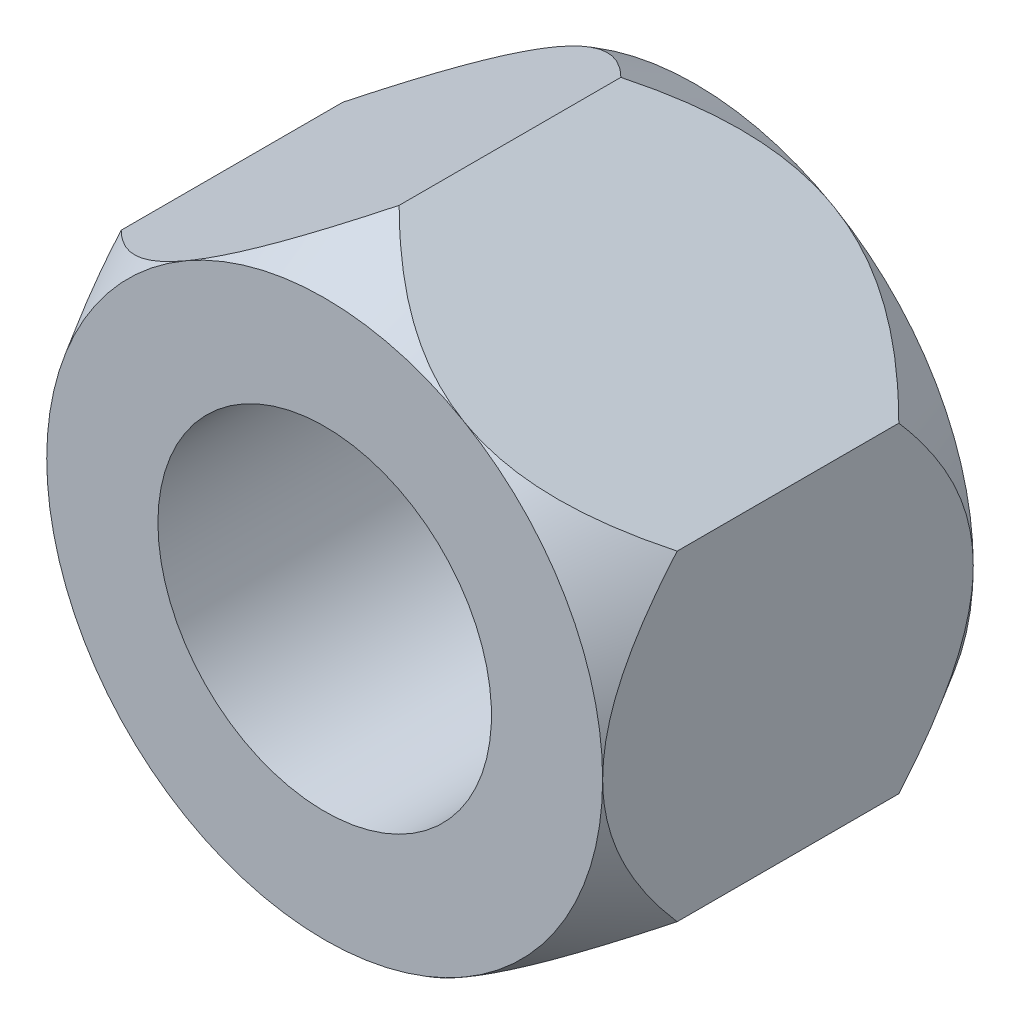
ISO-10303-21;
HEADER;
FILE_DESCRIPTION(('STEP AP214'),'2;1');
FILE_NAME('part.step','',(''),(''),'','','');
FILE_SCHEMA(('AUTOMOTIVE_DESIGN { 1 0 10303 214 1 1 1 1 }'));
ENDSEC;
DATA;
#1=APPLICATION_CONTEXT('core data for automotive mechanical design processes');
#2=APPLICATION_PROTOCOL_DEFINITION('international standard','automotive_design',2000,#1);
#3=PRODUCT_CONTEXT('',#1,'mechanical');
#4=PRODUCT('Part','Part','',(#3));
#5=PRODUCT_RELATED_PRODUCT_CATEGORY('part','',(#4));
#6=PRODUCT_DEFINITION_FORMATION('','',#4);
#7=PRODUCT_DEFINITION_CONTEXT('part definition',#1,'design');
#8=PRODUCT_DEFINITION('design','',#6,#7);
#9=PRODUCT_DEFINITION_SHAPE('','',#8);
#10=(LENGTH_UNIT() NAMED_UNIT(*) SI_UNIT(.MILLI.,.METRE.));
#11=(NAMED_UNIT(*) PLANE_ANGLE_UNIT() SI_UNIT($,.RADIAN.));
#12=(NAMED_UNIT(*) SI_UNIT($,.STERADIAN.) SOLID_ANGLE_UNIT());
#13=UNCERTAINTY_MEASURE_WITH_UNIT(LENGTH_MEASURE(1.E-05),#10,'distance_accuracy_value','');
#14=(GEOMETRIC_REPRESENTATION_CONTEXT(3) GLOBAL_UNCERTAINTY_ASSIGNED_CONTEXT((#13)) GLOBAL_UNIT_ASSIGNED_CONTEXT((#10,
#11,#12)) REPRESENTATION_CONTEXT('',''));
#15=CARTESIAN_POINT('',(0.,0.,0.));
#16=DIRECTION('',(0.,0.,1.));
#17=DIRECTION('',(1.,0.,0.));
#18=AXIS2_PLACEMENT_3D('',#15,#16,#17);
#19=CARTESIAN_POINT('',(15.,-8.66025403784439,10.));
#20=DIRECTION('',(-1.,0.,0.));
#21=DIRECTION('',(0.,-1.,0.));
#22=AXIS2_PLACEMENT_3D('',#19,#20,#21);
#23=PLANE('',#22);
#24=CARTESIAN_POINT('',(15.,-15.143036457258,0.937182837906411));
#25=CARTESIAN_POINT('',(15.,-14.8288624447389,0.550662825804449));
#26=CARTESIAN_POINT('',(15.,-14.5118354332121,0.166426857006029));
#27=CARTESIAN_POINT('',(15.,-13.8709660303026,-0.596487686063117));
#28=CARTESIAN_POINT('',(15.,-13.5471218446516,-0.975164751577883));
#29=CARTESIAN_POINT('',(15.,-12.8886156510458,-1.72926856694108));
#30=CARTESIAN_POINT('',(15.,-12.5538808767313,-2.10463197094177));
#31=CARTESIAN_POINT('',(15.,-11.8751992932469,-2.84689394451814));
#32=CARTESIAN_POINT('',(15.,-11.531253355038,-3.21379330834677));
#33=CARTESIAN_POINT('',(15.,-10.809771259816,-3.96067111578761));
#34=CARTESIAN_POINT('',(15.,-10.4315054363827,-4.33994791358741));
#35=CARTESIAN_POINT('',(15.,-9.66014183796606,-5.08340500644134));
#36=CARTESIAN_POINT('',(15.,-9.26704030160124,-5.44758142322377));
#37=CARTESIAN_POINT('',(15.,-8.46472785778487,-6.15462867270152));
#38=CARTESIAN_POINT('',(15.,-8.05558556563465,-6.49757687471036));
#39=CARTESIAN_POINT('',(15.,-7.21655079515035,-7.15687704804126));
#40=CARTESIAN_POINT('',(15.,-6.78667276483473,-7.47324712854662));
#41=CARTESIAN_POINT('',(15.,-6.05521199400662,-7.96675939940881));
#42=CARTESIAN_POINT('',(15.,-5.76061927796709,-8.1542389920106));
#43=CARTESIAN_POINT('',(15.,-5.15990320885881,-8.51014756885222));
#44=CARTESIAN_POINT('',(15.,-4.85377612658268,-8.67857032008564));
#45=CARTESIAN_POINT('',(15.,-4.23259610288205,-8.99035354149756));
#46=CARTESIAN_POINT('',(15.,-3.91765731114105,-9.13393945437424));
#47=CARTESIAN_POINT('',(15.,-3.27637761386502,-9.39292921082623));
#48=CARTESIAN_POINT('',(15.,-2.95004205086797,-9.50834606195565));
#49=CARTESIAN_POINT('',(15.,-2.37476383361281,-9.67971389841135));
#50=CARTESIAN_POINT('',(15.,-2.1280980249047,-9.7433203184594));
#51=CARTESIAN_POINT('',(15.,-1.6304302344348,-9.85046952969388));
#52=CARTESIAN_POINT('',(15.,-1.3794288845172,-9.89401521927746));
#53=CARTESIAN_POINT('',(15.,-0.874677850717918,-9.95951546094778));
#54=CARTESIAN_POINT('',(15.,-0.620929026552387,-9.98147658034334));
#55=CARTESIAN_POINT('',(15.,-0.112466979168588,-10.0029987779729));
#56=CARTESIAN_POINT('',(15.,0.142246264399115,-10.0025593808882));
#57=CARTESIAN_POINT('',(15.,0.650584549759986,-9.97929822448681));
#58=CARTESIAN_POINT('',(15.,0.90420980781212,-9.95648114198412));
#59=CARTESIAN_POINT('',(15.,1.40856698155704,-9.88933710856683));
#60=CARTESIAN_POINT('',(15.,1.65929889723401,-9.84501015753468));
#61=CARTESIAN_POINT('',(15.,2.15653293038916,-9.73634876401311));
#62=CARTESIAN_POINT('',(15.,2.40303202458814,-9.67200060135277));
#63=CARTESIAN_POINT('',(15.,2.89057908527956,-9.52526530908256));
#64=CARTESIAN_POINT('',(15.,3.13162625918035,-9.44287557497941));
#65=CARTESIAN_POINT('',(15.,3.74664508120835,-9.20939312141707));
#66=CARTESIAN_POINT('',(15.,4.11606200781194,-9.04627219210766));
#67=CARTESIAN_POINT('',(15.,4.83910271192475,-8.68809164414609));
#68=CARTESIAN_POINT('',(15.,5.19271548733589,-8.49301020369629));
#69=CARTESIAN_POINT('',(15.,5.71361473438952,-8.18048178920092));
#70=CARTESIAN_POINT('',(15.,5.88658505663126,-8.0723376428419));
#71=CARTESIAN_POINT('',(15.,6.2288419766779,-7.85035436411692));
#72=CARTESIAN_POINT('',(15.,6.39812853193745,-7.73651516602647));
#73=CARTESIAN_POINT('',(15.,6.73310833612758,-7.50386533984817));
#74=CARTESIAN_POINT('',(15.,6.8988034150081,-7.38505733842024));
#75=CARTESIAN_POINT('',(15.,7.22688616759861,-7.14298085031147));
#76=CARTESIAN_POINT('',(15.,7.38927393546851,-7.01971249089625));
#77=CARTESIAN_POINT('',(15.,7.89977326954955,-6.62218327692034));
#78=CARTESIAN_POINT('',(15.,8.24214605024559,-6.34052911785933));
#79=CARTESIAN_POINT('',(15.,8.91432900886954,-5.76254617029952));
#80=CARTESIAN_POINT('',(15.,9.24413542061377,-5.46621304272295));
#81=CARTESIAN_POINT('',(15.,9.89322695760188,-4.86158732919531));
#82=CARTESIAN_POINT('',(15.,10.2125003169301,-4.55328215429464));
#83=CARTESIAN_POINT('',(15.,10.8416304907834,-3.92730578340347));
#84=CARTESIAN_POINT('',(15.,11.1514882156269,-3.60963549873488));
#85=CARTESIAN_POINT('',(15.,11.7648493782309,-2.96476781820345));
#86=CARTESIAN_POINT('',(15.,12.0683063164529,-2.63752631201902));
#87=CARTESIAN_POINT('',(15.,12.6681175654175,-1.97660004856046));
#88=CARTESIAN_POINT('',(15.,12.9644717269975,-1.64291515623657));
#89=CARTESIAN_POINT('',(15.,13.5508133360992,-0.970350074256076));
#90=CARTESIAN_POINT('',(15.,13.8408044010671,-0.631473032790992));
#91=CARTESIAN_POINT('',(15.,14.415364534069,0.0508513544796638));
#92=CARTESIAN_POINT('',(15.,14.6999334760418,0.394298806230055));
#93=CARTESIAN_POINT('',(15.,15.4902870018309,1.36168314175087));
#94=CARTESIAN_POINT('',(15.,15.9907295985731,1.98998640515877));
#95=CARTESIAN_POINT('',(15.,16.9792388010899,3.25636751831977));
#96=CARTESIAN_POINT('',(15.,17.4673034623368,3.89444687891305));
#97=CARTESIAN_POINT('',(15.,18.4272478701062,5.17029871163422));
#98=CARTESIAN_POINT('',(15.,18.8992532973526,5.80797675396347));
#99=CARTESIAN_POINT('',(15.,19.6009933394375,6.76892210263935));
#100=CARTESIAN_POINT('',(15.,19.8338307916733,7.08993134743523));
#101=CARTESIAN_POINT('',(15.,20.2976048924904,7.73331492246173));
#102=CARTESIAN_POINT('',(15.,20.5285415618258,8.05568923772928));
#103=CARTESIAN_POINT('',(15.,20.7586135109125,8.37868000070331));
#104=B_SPLINE_CURVE_WITH_KNOTS('',3,(#24,#25,#26,#27,#28,#29,#30,#31,#32,#33,#34,#35,#36,#37,
#38,#39,#40,#41,#42,#43,#44,#45,#46,#47,#48,#49,#50,#51,#52,#53,#54,#55,#56,#57,#58,#59,#60,#61,
#62,#63,#64,#65,#66,#67,#68,#69,#70,#71,#72,#73,#74,#75,#76,#77,#78,#79,#80,#81,#82,#83,#84,#85,
#86,#87,#88,#89,#90,#91,#92,#93,#94,#95,#96,#97,#98,#99,#100,#101,#102,#103),.UNSPECIFIED.,.F.,
.F.,(4,2,2,2,2,2,2,2,2,2,2,2,2,2,2,2,2,2,2,2,2,2,2,2,2,2,2,2,2,2,2,2,2,2,2,2,2,2,2,4),(0.,
1.49432510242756,2.98904855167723,4.49772602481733,6.00626134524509,7.61292272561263,
9.21999422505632,10.8208140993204,12.4205342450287,13.4675378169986,14.5148828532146,
15.5521557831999,16.5889488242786,17.3524190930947,18.115779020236,18.8789066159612,
19.6420504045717,20.4050347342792,21.1680190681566,21.931527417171,22.6951460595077,
23.9045742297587,25.114831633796,25.7267242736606,26.3386239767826,26.9502042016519,
27.5617669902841,28.8911898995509,30.2210081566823,31.5522647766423,32.8833922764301,
34.2221358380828,35.5609074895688,36.8988972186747,38.2369180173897,40.6464425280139,
43.0563432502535,45.4363419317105,46.6260180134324,47.8156810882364),.UNSPECIFIED.);
#105=CARTESIAN_POINT('',(15.,8.66025403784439,-5.9807621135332));
#106=VERTEX_POINT('',#105);
#107=CARTESIAN_POINT('',(15.,0.,-10.));
#108=VERTEX_POINT('',#107);
#109=EDGE_CURVE('E469',#106,#108,#104,.F.);
#110=ORIENTED_EDGE('',*,*,#109,.F.);
#111=DIRECTION('',(0.,0.,-1.));
#112=VECTOR('',#111,1.);
#113=CARTESIAN_POINT('',(15.,8.66025403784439,10.));
#114=LINE('',#113,#112);
#115=CARTESIAN_POINT('',(15.,8.66025403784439,5.98076211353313));
#116=VERTEX_POINT('',#115);
#117=EDGE_CURVE('E153',#116,#106,#114,.T.);
#118=ORIENTED_EDGE('',*,*,#117,.F.);
#119=CARTESIAN_POINT('',(15.,-15.1430364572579,-0.937182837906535));
#120=CARTESIAN_POINT('',(15.,-14.8288624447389,-0.550662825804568));
#121=CARTESIAN_POINT('',(15.,-14.5118354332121,-0.166426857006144));
#122=CARTESIAN_POINT('',(15.,-13.8709660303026,0.596487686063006));
#123=CARTESIAN_POINT('',(15.,-13.5471218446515,0.975164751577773));
#124=CARTESIAN_POINT('',(15.,-12.8886156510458,1.72926856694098));
#125=CARTESIAN_POINT('',(15.,-12.5538808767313,2.10463197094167));
#126=CARTESIAN_POINT('',(15.,-11.8751992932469,2.84689394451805));
#127=CARTESIAN_POINT('',(15.,-11.531253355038,3.21379330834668));
#128=CARTESIAN_POINT('',(15.,-10.809771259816,3.96067111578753));
#129=CARTESIAN_POINT('',(15.,-10.4315054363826,4.33994791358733));
#130=CARTESIAN_POINT('',(15.,-9.66014183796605,5.08340500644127));
#131=CARTESIAN_POINT('',(15.,-9.26704030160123,5.44758142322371));
#132=CARTESIAN_POINT('',(15.,-8.46472785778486,6.15462867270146));
#133=CARTESIAN_POINT('',(15.,-8.05558556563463,6.49757687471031));
#134=CARTESIAN_POINT('',(15.,-7.21655079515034,7.15687704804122));
#135=CARTESIAN_POINT('',(15.,-6.78667276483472,7.47324712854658));
#136=CARTESIAN_POINT('',(15.,-6.05521199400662,7.96675939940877));
#137=CARTESIAN_POINT('',(15.,-5.76061927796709,8.15423899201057));
#138=CARTESIAN_POINT('',(15.,-5.15990320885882,8.51014756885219));
#139=CARTESIAN_POINT('',(15.,-4.85377612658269,8.6785703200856));
#140=CARTESIAN_POINT('',(15.,-4.23259610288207,8.99035354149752));
#141=CARTESIAN_POINT('',(15.,-3.91765731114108,9.1339394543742));
#142=CARTESIAN_POINT('',(15.,-3.27637761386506,9.39292921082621));
#143=CARTESIAN_POINT('',(15.,-2.95004205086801,9.50834606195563));
#144=CARTESIAN_POINT('',(15.,-2.37476383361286,9.67971389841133));
#145=CARTESIAN_POINT('',(15.,-2.12809802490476,9.74332031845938));
#146=CARTESIAN_POINT('',(15.,-1.63043023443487,9.85046952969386));
#147=CARTESIAN_POINT('',(15.,-1.37942888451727,9.89401521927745));
#148=CARTESIAN_POINT('',(15.,-0.874677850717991,9.95951546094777));
#149=CARTESIAN_POINT('',(15.,-0.620929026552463,9.98147658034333));
#150=CARTESIAN_POINT('',(15.,-0.112466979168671,10.0029987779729));
#151=CARTESIAN_POINT('',(15.,0.142246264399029,10.0025593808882));
#152=CARTESIAN_POINT('',(15.,0.650584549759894,9.97929822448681));
#153=CARTESIAN_POINT('',(15.,0.904209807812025,9.95648114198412));
#154=CARTESIAN_POINT('',(15.,1.40856698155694,9.88933710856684));
#155=CARTESIAN_POINT('',(15.,1.65929889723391,9.84501015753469));
#156=CARTESIAN_POINT('',(15.,2.15653293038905,9.73634876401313));
#157=CARTESIAN_POINT('',(15.,2.40303202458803,9.67200060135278));
#158=CARTESIAN_POINT('',(15.,2.89057908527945,9.52526530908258));
#159=CARTESIAN_POINT('',(15.,3.13162625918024,9.44287557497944));
#160=CARTESIAN_POINT('',(15.,3.74664508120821,9.2093931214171));
#161=CARTESIAN_POINT('',(15.,4.1160620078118,9.0462721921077));
#162=CARTESIAN_POINT('',(15.,4.83910271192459,8.68809164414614));
#163=CARTESIAN_POINT('',(15.,5.19271548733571,8.49301020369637));
#164=CARTESIAN_POINT('',(15.,5.71361473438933,8.180481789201));
#165=CARTESIAN_POINT('',(15.,5.88658505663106,8.07233764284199));
#166=CARTESIAN_POINT('',(15.,6.2288419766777,7.85035436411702));
#167=CARTESIAN_POINT('',(15.,6.39812853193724,7.73651516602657));
#168=CARTESIAN_POINT('',(15.,6.73310833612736,7.50386533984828));
#169=CARTESIAN_POINT('',(15.,6.89880341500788,7.38505733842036));
#170=CARTESIAN_POINT('',(15.,7.22688616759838,7.1429808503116));
#171=CARTESIAN_POINT('',(15.,7.38927393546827,7.01971249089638));
#172=CARTESIAN_POINT('',(15.,7.89977326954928,6.6221832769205));
#173=CARTESIAN_POINT('',(15.,8.24214605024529,6.3405291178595));
#174=CARTESIAN_POINT('',(15.,8.9143290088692,5.76254617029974));
#175=CARTESIAN_POINT('',(15.,9.24413542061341,5.4662130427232));
#176=CARTESIAN_POINT('',(15.,9.89322695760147,4.86158732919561));
#177=CARTESIAN_POINT('',(15.,10.2125003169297,4.55328215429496));
#178=CARTESIAN_POINT('',(15.,10.8416304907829,3.92730578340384));
#179=CARTESIAN_POINT('',(15.,11.1514882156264,3.60963549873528));
#180=CARTESIAN_POINT('',(15.,11.7648493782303,2.9647678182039));
#181=CARTESIAN_POINT('',(15.,12.0683063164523,2.63752631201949));
#182=CARTESIAN_POINT('',(15.,12.6681175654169,1.97660004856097));
#183=CARTESIAN_POINT('',(15.,12.9644717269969,1.64291515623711));
#184=CARTESIAN_POINT('',(15.,13.5508133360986,0.970350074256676));
#185=CARTESIAN_POINT('',(15.,13.8408044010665,0.631473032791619));
#186=CARTESIAN_POINT('',(15.,14.4153645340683,-0.0508513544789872));
#187=CARTESIAN_POINT('',(15.,14.6999334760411,-0.394298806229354));
#188=CARTESIAN_POINT('',(15.,15.4902870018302,-1.3616831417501));
#189=CARTESIAN_POINT('',(15.,15.9907295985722,-1.98998640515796));
#190=CARTESIAN_POINT('',(15.,16.979238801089,-3.25636751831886));
#191=CARTESIAN_POINT('',(15.,17.4673034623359,-3.8944468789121));
#192=CARTESIAN_POINT('',(15.,18.4272478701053,-5.17029871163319));
#193=CARTESIAN_POINT('',(15.,18.8992532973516,-5.80797675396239));
#194=CARTESIAN_POINT('',(15.,19.6009933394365,-6.76892210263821));
#195=CARTESIAN_POINT('',(15.,19.8338307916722,-7.08993134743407));
#196=CARTESIAN_POINT('',(15.,20.2976048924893,-7.73331492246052));
#197=CARTESIAN_POINT('',(15.,20.5285415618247,-8.05568923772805));
#198=CARTESIAN_POINT('',(15.,20.7586135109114,-8.37868000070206));
#199=B_SPLINE_CURVE_WITH_KNOTS('',3,(#119,#120,#121,#122,#123,#124,#125,#126,#127,#128,#129,
#130,#131,#132,#133,#134,#135,#136,#137,#138,#139,#140,#141,#142,#143,#144,#145,#146,#147,#148,
#149,#150,#151,#152,#153,#154,#155,#156,#157,#158,#159,#160,#161,#162,#163,#164,#165,#166,#167,
#168,#169,#170,#171,#172,#173,#174,#175,#176,#177,#178,#179,#180,#181,#182,#183,#184,#185,#186,
#187,#188,#189,#190,#191,#192,#193,#194,#195,#196,#197,#198),.UNSPECIFIED.,.F.,.F.,(4,2,2,2,2,2,
2,2,2,2,2,2,2,2,2,2,2,2,2,2,2,2,2,2,2,2,2,2,2,2,2,2,2,2,2,2,2,2,2,4),(0.,1.49432510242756,
2.98904855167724,4.49772602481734,6.0062613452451,7.61292272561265,9.21999422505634,
10.8208140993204,12.4205342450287,13.4675378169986,14.5148828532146,15.5521557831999,
16.5889488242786,17.3524190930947,18.1157790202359,18.8789066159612,19.6420504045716,
20.4050347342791,21.1680190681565,21.931527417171,22.6951460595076,23.9045742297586,
25.1148316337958,25.7267242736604,26.3386239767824,26.9502042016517,27.5617669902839,
28.8911898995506,30.2210081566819,31.5522647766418,32.8833922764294,34.222135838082,
35.560907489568,36.8988972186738,38.2369180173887,40.6464425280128,43.0563432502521,
45.4363419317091,46.6260180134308,47.8156810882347),.UNSPECIFIED.);
#200=CARTESIAN_POINT('',(15.,0.,9.99999999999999));
#201=VERTEX_POINT('',#200);
#202=EDGE_CURVE('E248',#201,#116,#199,.T.);
#203=ORIENTED_EDGE('',*,*,#202,.F.);
#204=CARTESIAN_POINT('',(15.,-8.6602540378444,5.98076211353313));
#205=VERTEX_POINT('',#204);
#206=EDGE_CURVE('E275',#205,#201,#199,.T.);
#207=ORIENTED_EDGE('',*,*,#206,.F.);
#208=DIRECTION('',(0.,0.,-1.));
#209=VECTOR('',#208,1.);
#210=CARTESIAN_POINT('',(15.,-8.66025403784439,10.));
#211=LINE('',#210,#209);
#212=CARTESIAN_POINT('',(15.,-8.6602540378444,-5.9807621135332));
#213=VERTEX_POINT('',#212);
#214=EDGE_CURVE('E282',#205,#213,#211,.T.);
#215=ORIENTED_EDGE('',*,*,#214,.T.);
#216=EDGE_CURVE('E464',#108,#213,#104,.F.);
#217=ORIENTED_EDGE('',*,*,#216,.F.);
#218=EDGE_LOOP('',(#110,#118,#203,#207,#215,#217));
#219=FACE_BOUND('',#218,.T.);
#220=ADVANCED_FACE('F38',(#219),#23,.F.);
#221=CARTESIAN_POINT('',(15.,8.66025403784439,10.));
#222=DIRECTION('',(-0.5,-0.866025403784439,0.));
#223=DIRECTION('',(0.866025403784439,-0.5,0.));
#224=AXIS2_PLACEMENT_3D('',#221,#222,#223);
#225=PLANE('',#224);
#226=CARTESIAN_POINT('',(-0.000199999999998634,17.3206235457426,-5.98056211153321));
#227=CARTESIAN_POINT('',(0.156681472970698,17.2300479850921,-6.13742612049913));
#228=CARTESIAN_POINT('',(0.315139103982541,17.1385624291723,-6.29221506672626));
#229=CARTESIAN_POINT('',(0.635530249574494,16.9535845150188,-6.59702491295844));
#230=CARTESIAN_POINT('',(0.797464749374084,16.8600915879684,-6.74704443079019));
#231=CARTESIAN_POINT('',(1.12590594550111,16.6704659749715,-7.04238224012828));
#232=CARTESIAN_POINT('',(1.29243222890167,16.574321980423,-7.18767161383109));
#233=CARTESIAN_POINT('',(1.62949973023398,16.3797159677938,-7.47185517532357));
#234=CARTESIAN_POINT('',(1.80004063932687,16.2812541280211,-7.61074985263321));
#235=CARTESIAN_POINT('',(2.32709068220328,15.97696164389,-8.02347750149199));
#236=CARTESIAN_POINT('',(2.69059115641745,15.7670945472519,-8.28563314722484));
#237=CARTESIAN_POINT('',(3.43724320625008,15.3360147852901,-8.76813857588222));
#238=CARTESIAN_POINT('',(3.8203488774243,15.1148286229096,-8.98858080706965));
#239=CARTESIAN_POINT('',(4.42755407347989,14.7642585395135,-9.28642452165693));
#240=CARTESIAN_POINT('',(4.64454123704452,14.6389809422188,-9.38322759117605));
#241=CARTESIAN_POINT('',(5.08419711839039,14.385145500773,-9.55806656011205));
#242=CARTESIAN_POINT('',(5.30686626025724,14.2565874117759,-9.63610105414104));
#243=CARTESIAN_POINT('',(5.75521665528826,13.9977321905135,-9.77041627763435));
#244=CARTESIAN_POINT('',(5.98085972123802,13.8674571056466,-9.82686554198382));
#245=CARTESIAN_POINT('',(6.4355676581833,13.6049313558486,-9.91685147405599));
#246=CARTESIAN_POINT('',(6.6646322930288,13.4726808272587,-9.95038971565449));
#247=CARTESIAN_POINT('',(7.12658201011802,13.2059740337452,-9.99340065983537));
#248=CARTESIAN_POINT('',(7.35948287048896,13.0715086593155,-10.0026502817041));
#249=CARTESIAN_POINT('',(7.82501178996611,12.8027354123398,-9.99603960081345));
#250=CARTESIAN_POINT('',(8.05763985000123,12.6684275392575,-9.98017938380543));
#251=CARTESIAN_POINT('',(8.52121070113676,12.4007847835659,-9.92396232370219));
#252=CARTESIAN_POINT('',(8.75214807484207,12.2674530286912,-9.88354649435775));
#253=CARTESIAN_POINT('',(9.2101076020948,12.0030499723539,-9.77979578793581));
#254=CARTESIAN_POINT('',(9.43712921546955,11.8719789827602,-9.71645777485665));
#255=CARTESIAN_POINT('',(9.9509444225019,11.5753276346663,-9.54777595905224));
#256=CARTESIAN_POINT('',(10.2360505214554,11.4107215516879,-9.43558249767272));
#257=CARTESIAN_POINT('',(10.7963841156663,11.0872128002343,-9.18214105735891));
#258=CARTESIAN_POINT('',(11.0716071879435,10.9283126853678,-9.04088025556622));
#259=CARTESIAN_POINT('',(11.6129141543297,10.6157889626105,-8.73386082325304));
#260=CARTESIAN_POINT('',(11.8789556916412,10.4621898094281,-8.56800359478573));
#261=CARTESIAN_POINT('',(12.4010519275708,10.1607574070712,-8.21676678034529));
#262=CARTESIAN_POINT('',(12.657108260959,10.0129232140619,-8.03139040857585));
#263=CARTESIAN_POINT('',(13.0927756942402,9.7613905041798,-7.69647365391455));
#264=CARTESIAN_POINT('',(13.2745233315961,9.65645845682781,-7.55060165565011));
#265=CARTESIAN_POINT('',(13.6334193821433,9.44924972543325,-7.25152790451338));
#266=CARTESIAN_POINT('',(13.810568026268,9.34697290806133,-7.09832652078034));
#267=CARTESIAN_POINT('',(14.1586478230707,9.14600894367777,-6.78736599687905));
#268=CARTESIAN_POINT('',(14.3296264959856,9.04729436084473,-6.62967749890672));
#269=CARTESIAN_POINT('',(14.6677200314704,8.85209596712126,-6.30894575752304));
#270=CARTESIAN_POINT('',(14.8348356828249,8.75561170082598,-6.14590362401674));
#271=CARTESIAN_POINT('',(15.0002,8.66013856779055,-5.98056211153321));
#272=B_SPLINE_CURVE_WITH_KNOTS('',3,(#226,#227,#228,#229,#230,#231,#232,#233,#234,#235,#236,
#237,#238,#239,#240,#241,#242,#243,#244,#245,#246,#247,#248,#249,#250,#251,#252,#253,#254,#255,
#256,#257,#258,#259,#260,#261,#262,#263,#264,#265,#266,#267,#268,#269,#270,#271),.UNSPECIFIED.,
.F.,.F.,(4,2,2,2,2,2,2,2,2,2,2,2,2,2,2,2,2,2,2,2,2,2,4),(0.,0.718895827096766,1.43799812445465,
2.16088732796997,2.88372110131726,4.36659494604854,5.84614282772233,6.65134572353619,
7.45660889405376,8.25544963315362,9.05423549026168,9.86033260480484,10.6664269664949,
11.4744653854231,12.2826143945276,13.3243244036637,14.3664949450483,15.4129621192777,
16.4592572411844,17.2258390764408,17.992382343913,18.7503041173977,19.5080697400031),.UNSPECIFIED.);
#273=CARTESIAN_POINT('',(0.,17.3205080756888,-5.9807621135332));
#274=VERTEX_POINT('',#273);
#275=CARTESIAN_POINT('',(7.5,12.9903810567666,-10.));
#276=VERTEX_POINT('',#275);
#277=EDGE_CURVE('E54',#274,#276,#272,.T.);
#278=ORIENTED_EDGE('',*,*,#277,.F.);
#279=DIRECTION('',(0.,0.,-1.));
#280=VECTOR('',#279,1.);
#281=CARTESIAN_POINT('',(0.,17.3205080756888,10.));
#282=LINE('',#281,#280);
#283=CARTESIAN_POINT('',(0.,17.3205080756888,5.98076211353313));
#284=VERTEX_POINT('',#283);
#285=EDGE_CURVE('E150',#284,#274,#282,.T.);
#286=ORIENTED_EDGE('',*,*,#285,.F.);
#287=CARTESIAN_POINT('',(15.0002,8.66013856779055,5.98056211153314));
#288=CARTESIAN_POINT('',(14.8433185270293,8.75071412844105,6.13742612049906));
#289=CARTESIAN_POINT('',(14.6848608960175,8.84219968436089,6.29221506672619));
#290=CARTESIAN_POINT('',(14.3644697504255,9.02717759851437,6.59702491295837));
#291=CARTESIAN_POINT('',(14.2025352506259,9.12067052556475,6.74704443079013));
#292=CARTESIAN_POINT('',(13.8740940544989,9.31029613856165,7.04238224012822));
#293=CARTESIAN_POINT('',(13.7075677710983,9.40644013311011,7.18767161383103));
#294=CARTESIAN_POINT('',(13.370500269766,9.6010461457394,7.47185517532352));
#295=CARTESIAN_POINT('',(13.1999593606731,9.69950798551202,7.61074985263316));
#296=CARTESIAN_POINT('',(12.6729093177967,10.0038004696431,8.02347750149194));
#297=CARTESIAN_POINT('',(12.3094088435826,10.2136675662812,8.2856331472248));
#298=CARTESIAN_POINT('',(11.5627567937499,10.6447473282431,8.76813857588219));
#299=CARTESIAN_POINT('',(11.1796511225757,10.8659334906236,8.98858080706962));
#300=CARTESIAN_POINT('',(10.5724459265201,11.2165035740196,9.2864245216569));
#301=CARTESIAN_POINT('',(10.3554587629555,11.3417811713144,9.38322759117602));
#302=CARTESIAN_POINT('',(9.91580288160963,11.5956166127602,9.55806656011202));
#303=CARTESIAN_POINT('',(9.69313373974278,11.7241747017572,9.63610105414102));
#304=CARTESIAN_POINT('',(9.24478334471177,11.9830299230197,9.77041627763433));
#305=CARTESIAN_POINT('',(9.01914027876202,12.1133050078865,9.82686554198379));
#306=CARTESIAN_POINT('',(8.56443234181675,12.3758307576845,9.91685147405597));
#307=CARTESIAN_POINT('',(8.33536770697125,12.5080812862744,9.95038971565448));
#308=CARTESIAN_POINT('',(7.87341798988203,12.7747880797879,9.99340065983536));
#309=CARTESIAN_POINT('',(7.6405171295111,12.9092534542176,10.0026502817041));
#310=CARTESIAN_POINT('',(7.17498821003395,13.1780267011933,9.99603960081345));
#311=CARTESIAN_POINT('',(6.94236014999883,13.3123345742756,9.98017938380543));
#312=CARTESIAN_POINT('',(6.47878929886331,13.5799773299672,9.9239623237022));
#313=CARTESIAN_POINT('',(6.24785192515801,13.7133090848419,9.88354649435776));
#314=CARTESIAN_POINT('',(5.78989239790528,13.9777121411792,9.77979578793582));
#315=CARTESIAN_POINT('',(5.56287078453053,14.108783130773,9.71645777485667));
#316=CARTESIAN_POINT('',(5.04905557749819,14.4054344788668,9.54777595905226));
#317=CARTESIAN_POINT('',(4.76394947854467,14.5700405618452,9.43558249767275));
#318=CARTESIAN_POINT('',(4.20361588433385,14.8935493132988,9.18214105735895));
#319=CARTESIAN_POINT('',(3.92839281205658,15.0524494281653,9.04088025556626));
#320=CARTESIAN_POINT('',(3.38708584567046,15.3649731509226,8.73386082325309));
#321=CARTESIAN_POINT('',(3.12104430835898,15.518572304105,8.56800359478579));
#322=CARTESIAN_POINT('',(2.59894807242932,15.8200047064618,8.21676678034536));
#323=CARTESIAN_POINT('',(2.34289173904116,15.9678388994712,8.03139040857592));
#324=CARTESIAN_POINT('',(1.90722430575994,16.2193716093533,7.69647365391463));
#325=CARTESIAN_POINT('',(1.72547666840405,16.3243036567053,7.55060165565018));
#326=CARTESIAN_POINT('',(1.36658061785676,16.5315123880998,7.25152790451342));
#327=CARTESIAN_POINT('',(1.18943197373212,16.6337892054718,7.09832652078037));
#328=CARTESIAN_POINT('',(0.841352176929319,16.8347531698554,6.78736599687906));
#329=CARTESIAN_POINT('',(0.670373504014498,16.9334677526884,6.62967749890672));
#330=CARTESIAN_POINT('',(0.332279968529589,17.1286661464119,6.30894575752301));
#331=CARTESIAN_POINT('',(0.165164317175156,17.2251504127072,6.1459036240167));
#332=CARTESIAN_POINT('',(-0.000200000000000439,17.3206235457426,5.98056211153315));
#333=B_SPLINE_CURVE_WITH_KNOTS('',3,(#287,#288,#289,#290,#291,#292,#293,#294,#295,#296,#297,
#298,#299,#300,#301,#302,#303,#304,#305,#306,#307,#308,#309,#310,#311,#312,#313,#314,#315,#316,
#317,#318,#319,#320,#321,#322,#323,#324,#325,#326,#327,#328,#329,#330,#331,#332),.UNSPECIFIED.,
.F.,.F.,(4,2,2,2,2,2,2,2,2,2,2,2,2,2,2,2,2,2,2,2,2,2,4),(0.,0.718895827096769,1.43799812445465,
2.16088732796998,2.88372110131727,4.36659494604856,5.84614282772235,6.6513457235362,
7.45660889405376,8.2554496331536,9.05423549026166,9.86033260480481,10.6664269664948,
11.474465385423,12.2826143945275,13.3243244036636,14.3664949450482,15.4129621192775,
16.4592572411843,17.2258390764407,17.9923823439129,18.7503041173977,19.5080697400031),.UNSPECIFIED.);
#334=CARTESIAN_POINT('',(7.5,12.9903810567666,9.99999999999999));
#335=VERTEX_POINT('',#334);
#336=EDGE_CURVE('E242',#335,#284,#333,.T.);
#337=ORIENTED_EDGE('',*,*,#336,.F.);
#338=EDGE_CURVE('E246',#116,#335,#333,.T.);
#339=ORIENTED_EDGE('',*,*,#338,.F.);
#340=ORIENTED_EDGE('',*,*,#117,.T.);
#341=EDGE_CURVE('E260',#276,#106,#272,.T.);
#342=ORIENTED_EDGE('',*,*,#341,.F.);
#343=EDGE_LOOP('',(#278,#286,#337,#339,#340,#342));
#344=FACE_BOUND('',#343,.T.);
#345=ADVANCED_FACE('F253',(#344),#225,.F.);
#346=CARTESIAN_POINT('',(0.,17.3205080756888,10.));
#347=DIRECTION('',(0.5,-0.866025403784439,0.));
#348=DIRECTION('',(0.866025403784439,0.5,0.));
#349=AXIS2_PLACEMENT_3D('',#346,#347,#348);
#350=PLANE('',#349);
#351=CARTESIAN_POINT('',(-15.0002,8.66013856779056,-5.98056211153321));
#352=CARTESIAN_POINT('',(-14.8433185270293,8.75071412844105,-6.13742612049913));
#353=CARTESIAN_POINT('',(-14.6848608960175,8.84219968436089,-6.29221506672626));
#354=CARTESIAN_POINT('',(-14.3644697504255,9.02717759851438,-6.59702491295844));
#355=CARTESIAN_POINT('',(-14.2025352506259,9.12067052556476,-6.74704443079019));
#356=CARTESIAN_POINT('',(-13.8740940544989,9.31029613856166,-7.04238224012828));
#357=CARTESIAN_POINT('',(-13.7075677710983,9.40644013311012,-7.18767161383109));
#358=CARTESIAN_POINT('',(-13.370500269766,9.6010461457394,-7.47185517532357));
#359=CARTESIAN_POINT('',(-13.1999593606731,9.69950798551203,-7.61074985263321));
#360=CARTESIAN_POINT('',(-12.6729093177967,10.0038004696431,-8.02347750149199));
#361=CARTESIAN_POINT('',(-12.3094088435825,10.2136675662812,-8.28563314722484));
#362=CARTESIAN_POINT('',(-11.5627567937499,10.6447473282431,-8.76813857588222));
#363=CARTESIAN_POINT('',(-11.1796511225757,10.8659334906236,-8.98858080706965));
#364=CARTESIAN_POINT('',(-10.5724459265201,11.2165035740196,-9.28642452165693));
#365=CARTESIAN_POINT('',(-10.3554587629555,11.3417811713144,-9.38322759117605));
#366=CARTESIAN_POINT('',(-9.91580288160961,11.5956166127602,-9.55806656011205));
#367=CARTESIAN_POINT('',(-9.69313373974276,11.7241747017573,-9.63610105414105));
#368=CARTESIAN_POINT('',(-9.24478334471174,11.9830299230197,-9.77041627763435));
#369=CARTESIAN_POINT('',(-9.01914027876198,12.1133050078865,-9.82686554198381));
#370=CARTESIAN_POINT('',(-8.5644323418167,12.3758307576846,-9.91685147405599));
#371=CARTESIAN_POINT('',(-8.3353677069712,12.5080812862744,-9.95038971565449));
#372=CARTESIAN_POINT('',(-7.87341798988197,12.774788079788,-9.99340065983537));
#373=CARTESIAN_POINT('',(-7.64051712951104,12.9092534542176,-10.0026502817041));
#374=CARTESIAN_POINT('',(-7.17498821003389,13.1780267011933,-9.99603960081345));
#375=CARTESIAN_POINT('',(-6.94236014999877,13.3123345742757,-9.98017938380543));
#376=CARTESIAN_POINT('',(-6.47878929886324,13.5799773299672,-9.92396232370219));
#377=CARTESIAN_POINT('',(-6.24785192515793,13.7133090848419,-9.88354649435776));
#378=CARTESIAN_POINT('',(-5.7898923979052,13.9777121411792,-9.77979578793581));
#379=CARTESIAN_POINT('',(-5.56287078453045,14.108783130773,-9.71645777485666));
#380=CARTESIAN_POINT('',(-5.0490555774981,14.4054344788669,-9.54777595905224));
#381=CARTESIAN_POINT('',(-4.76394947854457,14.5700405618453,-9.43558249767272));
#382=CARTESIAN_POINT('',(-4.20361588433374,14.8935493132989,-9.18214105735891));
#383=CARTESIAN_POINT('',(-3.92839281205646,15.0524494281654,-9.04088025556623));
#384=CARTESIAN_POINT('',(-3.38708584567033,15.3649731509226,-8.73386082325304));
#385=CARTESIAN_POINT('',(-3.12104430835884,15.518572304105,-8.56800359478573));
#386=CARTESIAN_POINT('',(-2.59894807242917,15.8200047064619,-8.21676678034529));
#387=CARTESIAN_POINT('',(-2.342891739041,15.9678388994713,-8.03139040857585));
#388=CARTESIAN_POINT('',(-1.90722430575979,16.2193716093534,-7.69647365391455));
#389=CARTESIAN_POINT('',(-1.72547666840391,16.3243036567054,-7.55060165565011));
#390=CARTESIAN_POINT('',(-1.36658061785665,16.5315123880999,-7.25152790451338));
#391=CARTESIAN_POINT('',(-1.18943197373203,16.6337892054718,-7.09832652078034));
#392=CARTESIAN_POINT('',(-0.841352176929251,16.8347531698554,-6.78736599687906));
#393=CARTESIAN_POINT('',(-0.670373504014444,16.9334677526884,-6.62967749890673));
#394=CARTESIAN_POINT('',(-0.332279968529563,17.1286661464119,-6.30894575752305));
#395=CARTESIAN_POINT('',(-0.165164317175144,17.2251504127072,-6.14590362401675));
#396=CARTESIAN_POINT('',(0.000200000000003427,17.3206235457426,-5.98056211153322));
#397=B_SPLINE_CURVE_WITH_KNOTS('',3,(#351,#352,#353,#354,#355,#356,#357,#358,#359,#360,#361,
#362,#363,#364,#365,#366,#367,#368,#369,#370,#371,#372,#373,#374,#375,#376,#377,#378,#379,#380,
#381,#382,#383,#384,#385,#386,#387,#388,#389,#390,#391,#392,#393,#394,#395,#396),.UNSPECIFIED.,
.F.,.F.,(4,2,2,2,2,2,2,2,2,2,2,2,2,2,2,2,2,2,2,2,2,2,4),(0.,0.718895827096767,1.43799812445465,
2.16088732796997,2.88372110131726,4.36659494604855,5.84614282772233,6.65134572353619,
7.45660889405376,8.25544963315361,9.05423549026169,9.86033260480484,10.6664269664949,
11.4744653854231,12.2826143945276,13.3243244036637,14.3664949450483,15.4129621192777,
16.4592572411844,17.2258390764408,17.992382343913,18.7503041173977,19.508069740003),.UNSPECIFIED.);
#398=CARTESIAN_POINT('',(-15.,8.66025403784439,-5.9807621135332));
#399=VERTEX_POINT('',#398);
#400=CARTESIAN_POINT('',(-7.5,12.9903810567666,-10.));
#401=VERTEX_POINT('',#400);
#402=EDGE_CURVE('E61',#399,#401,#397,.T.);
#403=ORIENTED_EDGE('',*,*,#402,.F.);
#404=DIRECTION('',(0.,0.,-1.));
#405=VECTOR('',#404,1.);
#406=CARTESIAN_POINT('',(-15.,8.66025403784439,10.));
#407=LINE('',#406,#405);
#408=CARTESIAN_POINT('',(-15.,8.66025403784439,5.98076211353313));
#409=VERTEX_POINT('',#408);
#410=EDGE_CURVE('E142',#409,#399,#407,.T.);
#411=ORIENTED_EDGE('',*,*,#410,.F.);
#412=CARTESIAN_POINT('',(0.000200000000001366,17.3206235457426,5.98056211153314));
#413=CARTESIAN_POINT('',(-0.156681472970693,17.2300479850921,6.13742612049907));
#414=CARTESIAN_POINT('',(-0.315139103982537,17.1385624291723,6.29221506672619));
#415=CARTESIAN_POINT('',(-0.635530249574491,16.9535845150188,6.59702491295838));
#416=CARTESIAN_POINT('',(-0.797464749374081,16.8600915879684,6.74704443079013));
#417=CARTESIAN_POINT('',(-1.12590594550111,16.6704659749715,7.04238224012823));
#418=CARTESIAN_POINT('',(-1.29243222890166,16.574321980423,7.18767161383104));
#419=CARTESIAN_POINT('',(-1.62949973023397,16.3797159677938,7.47185517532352));
#420=CARTESIAN_POINT('',(-1.80004063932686,16.2812541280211,7.61074985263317));
#421=CARTESIAN_POINT('',(-2.32709068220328,15.97696164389,8.02347750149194));
#422=CARTESIAN_POINT('',(-2.69059115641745,15.7670945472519,8.28563314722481));
#423=CARTESIAN_POINT('',(-3.43724320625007,15.3360147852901,8.76813857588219));
#424=CARTESIAN_POINT('',(-3.8203488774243,15.1148286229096,8.98858080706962));
#425=CARTESIAN_POINT('',(-4.42755407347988,14.7642585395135,9.28642452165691));
#426=CARTESIAN_POINT('',(-4.64454123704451,14.6389809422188,9.38322759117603));
#427=CARTESIAN_POINT('',(-5.08419711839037,14.385145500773,9.55806656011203));
#428=CARTESIAN_POINT('',(-5.30686626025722,14.2565874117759,9.63610105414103));
#429=CARTESIAN_POINT('',(-5.75521665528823,13.9977321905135,9.77041627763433));
#430=CARTESIAN_POINT('',(-5.98085972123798,13.8674571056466,9.8268655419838));
#431=CARTESIAN_POINT('',(-6.43556765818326,13.6049313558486,9.91685147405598));
#432=CARTESIAN_POINT('',(-6.66463229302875,13.4726808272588,9.95038971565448));
#433=CARTESIAN_POINT('',(-7.12658201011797,13.2059740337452,9.99340065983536));
#434=CARTESIAN_POINT('',(-7.3594828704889,13.0715086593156,10.0026502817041));
#435=CARTESIAN_POINT('',(-7.82501178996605,12.8027354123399,9.99603960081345));
#436=CARTESIAN_POINT('',(-8.05763985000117,12.6684275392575,9.98017938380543));
#437=CARTESIAN_POINT('',(-8.52121070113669,12.400784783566,9.9239623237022));
#438=CARTESIAN_POINT('',(-8.752148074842,12.2674530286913,9.88354649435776));
#439=CARTESIAN_POINT('',(-9.21010760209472,12.003049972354,9.77979578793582));
#440=CARTESIAN_POINT('',(-9.43712921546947,11.8719789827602,9.71645777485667));
#441=CARTESIAN_POINT('',(-9.95094442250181,11.5753276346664,9.54777595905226));
#442=CARTESIAN_POINT('',(-10.2360505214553,11.4107215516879,9.43558249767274));
#443=CARTESIAN_POINT('',(-10.7963841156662,11.0872128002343,9.18214105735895));
#444=CARTESIAN_POINT('',(-11.0716071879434,10.9283126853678,9.04088025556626));
#445=CARTESIAN_POINT('',(-11.6129141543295,10.6157889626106,8.73386082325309));
#446=CARTESIAN_POINT('',(-11.878955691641,10.4621898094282,8.56800359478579));
#447=CARTESIAN_POINT('',(-12.4010519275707,10.1607574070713,8.21676678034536));
#448=CARTESIAN_POINT('',(-12.6571082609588,10.012923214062,8.03139040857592));
#449=CARTESIAN_POINT('',(-13.0927756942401,9.76139050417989,7.69647365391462));
#450=CARTESIAN_POINT('',(-13.274523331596,9.65645845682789,7.55060165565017));
#451=CARTESIAN_POINT('',(-13.6334193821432,9.44924972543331,7.25152790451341));
#452=CARTESIAN_POINT('',(-13.8105680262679,9.34697290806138,7.09832652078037));
#453=CARTESIAN_POINT('',(-14.1586478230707,9.14600894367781,6.78736599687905));
#454=CARTESIAN_POINT('',(-14.3296264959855,9.04729436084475,6.62967749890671));
#455=CARTESIAN_POINT('',(-14.6677200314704,8.85209596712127,6.308945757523));
#456=CARTESIAN_POINT('',(-14.8348356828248,8.75561170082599,6.14590362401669));
#457=CARTESIAN_POINT('',(-15.0002,8.66013856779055,5.98056211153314));
#458=B_SPLINE_CURVE_WITH_KNOTS('',3,(#412,#413,#414,#415,#416,#417,#418,#419,#420,#421,#422,
#423,#424,#425,#426,#427,#428,#429,#430,#431,#432,#433,#434,#435,#436,#437,#438,#439,#440,#441,
#442,#443,#444,#445,#446,#447,#448,#449,#450,#451,#452,#453,#454,#455,#456,#457),.UNSPECIFIED.,
.F.,.F.,(4,2,2,2,2,2,2,2,2,2,2,2,2,2,2,2,2,2,2,2,2,2,4),(0.,0.71889582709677,1.43799812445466,
2.16088732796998,2.88372110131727,4.36659494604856,5.84614282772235,6.6513457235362,
7.45660889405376,8.2554496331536,9.05423549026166,9.86033260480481,10.6664269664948,
11.474465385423,12.2826143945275,13.3243244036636,14.3664949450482,15.4129621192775,
16.4592572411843,17.2258390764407,17.9923823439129,18.7503041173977,19.5080697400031),.UNSPECIFIED.);
#459=CARTESIAN_POINT('',(-7.5,12.9903810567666,9.99999999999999));
#460=VERTEX_POINT('',#459);
#461=EDGE_CURVE('E236',#460,#409,#458,.T.);
#462=ORIENTED_EDGE('',*,*,#461,.F.);
#463=EDGE_CURVE('E247',#284,#460,#458,.T.);
#464=ORIENTED_EDGE('',*,*,#463,.F.);
#465=ORIENTED_EDGE('',*,*,#285,.T.);
#466=EDGE_CURVE('E134',#401,#274,#397,.T.);
#467=ORIENTED_EDGE('',*,*,#466,.F.);
#468=EDGE_LOOP('',(#403,#411,#462,#464,#465,#467));
#469=FACE_BOUND('',#468,.T.);
#470=ADVANCED_FACE('F140',(#469),#350,.F.);
#471=CARTESIAN_POINT('',(-15.,8.66025403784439,10.));
#472=DIRECTION('',(1.,0.,0.));
#473=DIRECTION('',(0.,1.,0.));
#474=AXIS2_PLACEMENT_3D('',#471,#472,#473);
#475=PLANE('',#474);
#476=CARTESIAN_POINT('',(-15.,-15.143036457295,0.937182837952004));
#477=CARTESIAN_POINT('',(-15.,-14.8288624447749,0.550662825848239));
#478=CARTESIAN_POINT('',(-15.,-14.511835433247,0.166426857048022));
#479=CARTESIAN_POINT('',(-15.,-13.8709660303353,-0.596487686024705));
#480=CARTESIAN_POINT('',(-15.,-13.5471218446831,-0.975164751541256));
#481=CARTESIAN_POINT('',(-15.,-12.8886156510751,-1.72926856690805));
#482=CARTESIAN_POINT('',(-15.,-12.5538808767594,-2.10463197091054));
#483=CARTESIAN_POINT('',(-15.,-11.8751992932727,-2.84689394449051));
#484=CARTESIAN_POINT('',(-15.,-11.5312533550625,-3.21379330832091));
#485=CARTESIAN_POINT('',(-15.,-10.8097712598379,-3.96067111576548));
#486=CARTESIAN_POINT('',(-15.,-10.4315054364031,-4.33994791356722));
#487=CARTESIAN_POINT('',(-15.,-9.66014183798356,-5.08340500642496));
#488=CARTESIAN_POINT('',(-15.,-9.26704030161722,-5.44758142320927));
#489=CARTESIAN_POINT('',(-15.,-8.46472785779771,-6.15462867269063));
#490=CARTESIAN_POINT('',(-15.,-8.05558556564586,-6.49757687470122));
#491=CARTESIAN_POINT('',(-15.,-7.21655079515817,-7.15687704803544));
#492=CARTESIAN_POINT('',(-15.,-6.78667276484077,-7.47324712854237));
#493=CARTESIAN_POINT('',(-15.,-6.05521199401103,-7.96675939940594));
#494=CARTESIAN_POINT('',(-15.,-5.76061927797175,-8.1542389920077));
#495=CARTESIAN_POINT('',(-15.,-5.15990320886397,-8.51014756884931));
#496=CARTESIAN_POINT('',(-15.,-4.8537761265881,-8.67857032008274));
#497=CARTESIAN_POINT('',(-15.,-4.232596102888,-8.99035354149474));
#498=CARTESIAN_POINT('',(-15.,-3.91765731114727,-9.1339394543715));
#499=CARTESIAN_POINT('',(-15.,-3.27637761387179,-9.39292921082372));
#500=CARTESIAN_POINT('',(-15.,-2.95004205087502,-9.50834606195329));
#501=CARTESIAN_POINT('',(-15.,-2.37476383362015,-9.67971389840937));
#502=CARTESIAN_POINT('',(-15.,-2.12809802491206,-9.74332031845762));
#503=CARTESIAN_POINT('',(-15.,-1.63043023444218,-9.8504695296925));
#504=CARTESIAN_POINT('',(-15.,-1.37942888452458,-9.89401521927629));
#505=CARTESIAN_POINT('',(-15.,-0.874677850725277,-9.95951546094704));
#506=CARTESIAN_POINT('',(-15.,-0.62092902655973,-9.98147658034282));
#507=CARTESIAN_POINT('',(-15.,-0.112466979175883,-10.0029987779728));
#508=CARTESIAN_POINT('',(-15.,0.142246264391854,-10.0025593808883));
#509=CARTESIAN_POINT('',(-15.,0.650584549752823,-9.97929822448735));
#510=CARTESIAN_POINT('',(-15.,0.904209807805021,-9.95648114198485));
#511=CARTESIAN_POINT('',(-15.,1.40856698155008,-9.88933710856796));
#512=CARTESIAN_POINT('',(-15.,1.65929889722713,-9.845010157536));
#513=CARTESIAN_POINT('',(-15.,2.15653293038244,-9.73634876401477));
#514=CARTESIAN_POINT('',(-15.,2.40303202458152,-9.67200060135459));
#515=CARTESIAN_POINT('',(-15.,2.89057908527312,-9.52526530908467));
#516=CARTESIAN_POINT('',(-15.,3.131626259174,-9.44287557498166));
#517=CARTESIAN_POINT('',(-15.,3.74664508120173,-9.20939312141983));
#518=CARTESIAN_POINT('',(-15.,4.11606200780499,-9.04627219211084));
#519=CARTESIAN_POINT('',(-15.,4.83910271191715,-8.68809164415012));
#520=CARTESIAN_POINT('',(-15.,5.19271548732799,-8.49301020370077));
#521=CARTESIAN_POINT('',(-15.,5.71361473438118,-8.18048178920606));
#522=CARTESIAN_POINT('',(-15.,5.88658505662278,-8.07233764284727));
#523=CARTESIAN_POINT('',(-15.,6.22884197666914,-7.85035436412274));
#524=CARTESIAN_POINT('',(-15.,6.39812853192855,-7.73651516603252));
#525=CARTESIAN_POINT('',(-15.,6.73310833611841,-7.50386533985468));
#526=CARTESIAN_POINT('',(-15.,6.8988034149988,-7.38505733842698));
#527=CARTESIAN_POINT('',(-15.,7.22688616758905,-7.14298085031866));
#528=CARTESIAN_POINT('',(-15.,7.38927393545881,-7.01971249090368));
#529=CARTESIAN_POINT('',(-15.,7.89977326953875,-6.62218327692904));
#530=CARTESIAN_POINT('',(-15.,8.24214605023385,-6.3405291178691));
#531=CARTESIAN_POINT('',(-15.,8.91432900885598,-5.7625461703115));
#532=CARTESIAN_POINT('',(-15.,9.24413542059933,-5.46621304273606));
#533=CARTESIAN_POINT('',(-15.,9.89322695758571,-4.86158732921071));
#534=CARTESIAN_POINT('',(-15.,10.2125003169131,-4.55328215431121));
#535=CARTESIAN_POINT('',(-15.,10.8416304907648,-3.92730578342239));
#536=CARTESIAN_POINT('',(-15.,11.1514882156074,-3.60963549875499));
#537=CARTESIAN_POINT('',(-15.,11.7648493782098,-2.96476781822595));
#538=CARTESIAN_POINT('',(-15.,12.068306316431,-2.63752631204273));
#539=CARTESIAN_POINT('',(-15.,12.6681175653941,-1.9766000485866));
#540=CARTESIAN_POINT('',(-15.,12.9644717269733,-1.64291515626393));
#541=CARTESIAN_POINT('',(-15.,13.5508133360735,-0.970350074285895));
#542=CARTESIAN_POINT('',(-15.,13.8408044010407,-0.631473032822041));
#543=CARTESIAN_POINT('',(-15.,14.4153645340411,0.0508513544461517));
#544=CARTESIAN_POINT('',(-15.,14.6999334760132,0.394298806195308));
#545=CARTESIAN_POINT('',(-15.,15.4902870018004,1.36168314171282));
#546=CARTESIAN_POINT('',(-15.,15.9907295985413,1.98998640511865));
#547=CARTESIAN_POINT('',(-15.,16.9792388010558,3.2563675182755));
#548=CARTESIAN_POINT('',(-15.,17.4673034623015,3.8944468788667));
#549=CARTESIAN_POINT('',(-15.,18.4272478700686,5.17029871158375));
#550=CARTESIAN_POINT('',(-15.,18.8992532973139,5.80797675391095));
#551=CARTESIAN_POINT('',(-15.,19.6009933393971,6.76892210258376));
#552=CARTESIAN_POINT('',(-15.,19.8338307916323,7.08993134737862));
#553=CARTESIAN_POINT('',(-15.,20.2976048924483,7.73331492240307));
#554=CARTESIAN_POINT('',(-15.,20.5285415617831,8.0556892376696));
#555=CARTESIAN_POINT('',(-15.,20.7586135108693,8.3786800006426));
#556=B_SPLINE_CURVE_WITH_KNOTS('',3,(#476,#477,#478,#479,#480,#481,#482,#483,#484,#485,#486,
#487,#488,#489,#490,#491,#492,#493,#494,#495,#496,#497,#498,#499,#500,#501,#502,#503,#504,#505,
#506,#507,#508,#509,#510,#511,#512,#513,#514,#515,#516,#517,#518,#519,#520,#521,#522,#523,#524,
#525,#526,#527,#528,#529,#530,#531,#532,#533,#534,#535,#536,#537,#538,#539,#540,#541,#542,#543,
#544,#545,#546,#547,#548,#549,#550,#551,#552,#553,#554,#555),.UNSPECIFIED.,.F.,.F.,(4,2,2,2,2,2,
2,2,2,2,2,2,2,2,2,2,2,2,2,2,2,2,2,2,2,2,2,2,2,2,2,2,2,2,2,2,2,2,2,4),(0.,1.4943251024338,
2.98904855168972,4.4977260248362,6.00626134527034,7.61292272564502,9.21999422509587,
10.820814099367,12.4205342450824,13.4675378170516,14.5148828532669,15.5521557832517,
16.5889488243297,17.3524190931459,18.1157790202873,18.8789066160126,19.6420504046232,
20.4050347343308,21.1680190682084,21.931527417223,22.6951460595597,23.9045742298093,
25.1148316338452,25.7267242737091,26.3386239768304,26.950204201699,27.5617669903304,
28.891189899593,30.2210081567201,31.5522647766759,32.8833922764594,34.2221358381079,
35.5609074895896,36.8988972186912,38.236918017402,40.6464425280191,43.0563432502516,
45.4363419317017,46.6260180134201,47.8156810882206),.UNSPECIFIED.);
#557=CARTESIAN_POINT('',(-15.,-8.66025403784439,-5.9807621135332));
#558=VERTEX_POINT('',#557);
#559=CARTESIAN_POINT('',(-15.,0.,-10.));
#560=VERTEX_POINT('',#559);
#561=EDGE_CURVE('E136',#558,#560,#556,.T.);
#562=ORIENTED_EDGE('',*,*,#561,.F.);
#563=DIRECTION('',(0.,0.,-1.));
#564=VECTOR('',#563,1.);
#565=CARTESIAN_POINT('',(-15.,-8.66025403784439,10.));
#566=LINE('',#565,#564);
#567=CARTESIAN_POINT('',(-15.,-8.66025403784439,5.98076211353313));
#568=VERTEX_POINT('',#567);
#569=EDGE_CURVE('E151',#568,#558,#566,.T.);
#570=ORIENTED_EDGE('',*,*,#569,.F.);
#571=CARTESIAN_POINT('',(-15.,-15.143036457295,-0.937182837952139));
#572=CARTESIAN_POINT('',(-15.,-14.8288624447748,-0.550662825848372));
#573=CARTESIAN_POINT('',(-15.,-14.511835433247,-0.166426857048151));
#574=CARTESIAN_POINT('',(-15.,-13.8709660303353,0.596487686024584));
#575=CARTESIAN_POINT('',(-15.,-13.5471218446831,0.975164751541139));
#576=CARTESIAN_POINT('',(-15.,-12.8886156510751,1.72926856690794));
#577=CARTESIAN_POINT('',(-15.,-12.5538808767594,2.10463197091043));
#578=CARTESIAN_POINT('',(-15.,-11.8751992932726,2.8468939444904));
#579=CARTESIAN_POINT('',(-15.,-11.5312533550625,3.21379330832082));
#580=CARTESIAN_POINT('',(-15.,-10.8097712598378,3.96067111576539));
#581=CARTESIAN_POINT('',(-15.,-10.4315054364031,4.33994791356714));
#582=CARTESIAN_POINT('',(-15.,-9.66014183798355,5.08340500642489));
#583=CARTESIAN_POINT('',(-15.,-9.26704030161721,5.44758142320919));
#584=CARTESIAN_POINT('',(-15.,-8.4647278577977,6.15462867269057));
#585=CARTESIAN_POINT('',(-15.,-8.05558556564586,6.49757687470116));
#586=CARTESIAN_POINT('',(-15.,-7.21655079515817,7.15687704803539));
#587=CARTESIAN_POINT('',(-15.,-6.78667276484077,7.47324712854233));
#588=CARTESIAN_POINT('',(-15.,-6.05521199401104,7.9667593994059));
#589=CARTESIAN_POINT('',(-15.,-5.76061927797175,8.15423899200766));
#590=CARTESIAN_POINT('',(-15.,-5.15990320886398,8.51014756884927));
#591=CARTESIAN_POINT('',(-15.,-4.85377612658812,8.6785703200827));
#592=CARTESIAN_POINT('',(-15.,-4.23259610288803,8.99035354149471));
#593=CARTESIAN_POINT('',(-15.,-3.9176573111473,9.13393945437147));
#594=CARTESIAN_POINT('',(-15.,-3.27637761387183,9.39292921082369));
#595=CARTESIAN_POINT('',(-15.,-2.95004205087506,9.50834606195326));
#596=CARTESIAN_POINT('',(-15.,-2.37476383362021,9.67971389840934));
#597=CARTESIAN_POINT('',(-15.,-2.12809802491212,9.74332031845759));
#598=CARTESIAN_POINT('',(-15.,-1.63043023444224,9.85046952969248));
#599=CARTESIAN_POINT('',(-15.,-1.37942888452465,9.89401521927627));
#600=CARTESIAN_POINT('',(-15.,-0.874677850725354,9.95951546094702));
#601=CARTESIAN_POINT('',(-15.,-0.62092902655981,9.98147658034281));
#602=CARTESIAN_POINT('',(-15.,-0.11246697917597,10.0029987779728));
#603=CARTESIAN_POINT('',(-15.,0.142246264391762,10.0025593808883));
#604=CARTESIAN_POINT('',(-15.,0.650584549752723,9.97929822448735));
#605=CARTESIAN_POINT('',(-15.,0.904209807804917,9.95648114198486));
#606=CARTESIAN_POINT('',(-15.,1.40856698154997,9.88933710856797));
#607=CARTESIAN_POINT('',(-15.,1.65929889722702,9.84501015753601));
#608=CARTESIAN_POINT('',(-15.,2.15653293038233,9.73634876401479));
#609=CARTESIAN_POINT('',(-15.,2.40303202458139,9.67200060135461));
#610=CARTESIAN_POINT('',(-15.,2.89057908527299,9.5252653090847));
#611=CARTESIAN_POINT('',(-15.,3.13162625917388,9.4428755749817));
#612=CARTESIAN_POINT('',(-15.,3.74664508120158,9.20939312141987));
#613=CARTESIAN_POINT('',(-15.,4.11606200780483,9.04627219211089));
#614=CARTESIAN_POINT('',(-15.,4.83910271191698,8.68809164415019));
#615=CARTESIAN_POINT('',(-15.,5.1927154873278,8.49301020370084));
#616=CARTESIAN_POINT('',(-15.,5.71361473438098,8.18048178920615));
#617=CARTESIAN_POINT('',(-15.,5.88658505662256,8.07233764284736));
#618=CARTESIAN_POINT('',(-15.,6.22884197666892,7.85035436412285));
#619=CARTESIAN_POINT('',(-15.,6.39812853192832,7.73651516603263));
#620=CARTESIAN_POINT('',(-15.,6.73310833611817,7.5038653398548));
#621=CARTESIAN_POINT('',(-15.,6.89880341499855,7.38505733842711));
#622=CARTESIAN_POINT('',(-15.,7.22688616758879,7.1429808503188));
#623=CARTESIAN_POINT('',(-15.,7.38927393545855,7.01971249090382));
#624=CARTESIAN_POINT('',(-15.,7.89977326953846,6.62218327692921));
#625=CARTESIAN_POINT('',(-15.,8.24214605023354,6.3405291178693));
#626=CARTESIAN_POINT('',(-15.,8.91432900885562,5.76254617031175));
#627=CARTESIAN_POINT('',(-15.,9.24413542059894,5.46621304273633));
#628=CARTESIAN_POINT('',(-15.,9.89322695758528,4.86158732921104));
#629=CARTESIAN_POINT('',(-15.,10.2125003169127,4.55328215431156));
#630=CARTESIAN_POINT('',(-15.,10.8416304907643,3.9273057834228));
#631=CARTESIAN_POINT('',(-15.,11.1514882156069,3.60963549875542));
#632=CARTESIAN_POINT('',(-15.,11.7648493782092,2.96476781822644));
#633=CARTESIAN_POINT('',(-15.,12.0683063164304,2.63752631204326));
#634=CARTESIAN_POINT('',(-15.,12.6681175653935,1.97660004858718));
#635=CARTESIAN_POINT('',(-15.,12.9644717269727,1.64291515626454));
#636=CARTESIAN_POINT('',(-15.,13.5508133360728,0.970350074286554));
#637=CARTESIAN_POINT('',(-15.,13.84080440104,0.631473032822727));
#638=CARTESIAN_POINT('',(-15.,14.4153645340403,-0.0508513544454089));
#639=CARTESIAN_POINT('',(-15.,14.6999334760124,-0.394298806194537));
#640=CARTESIAN_POINT('',(-15.,15.4902870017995,-1.36168314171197));
#641=CARTESIAN_POINT('',(-15.,15.9907295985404,-1.98998640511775));
#642=CARTESIAN_POINT('',(-15.,16.9792388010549,-3.25636751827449));
#643=CARTESIAN_POINT('',(-15.,17.4673034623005,-3.89444687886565));
#644=CARTESIAN_POINT('',(-15.,18.4272478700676,-5.1702987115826));
#645=CARTESIAN_POINT('',(-15.,18.8992532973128,-5.80797675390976));
#646=CARTESIAN_POINT('',(-15.,19.600993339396,-6.76892210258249));
#647=CARTESIAN_POINT('',(-15.,19.8338307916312,-7.08993134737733));
#648=CARTESIAN_POINT('',(-15.,20.2976048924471,-7.73331492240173));
#649=CARTESIAN_POINT('',(-15.,20.5285415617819,-8.05568923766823));
#650=CARTESIAN_POINT('',(-15.,20.7586135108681,-8.37868000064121));
#651=B_SPLINE_CURVE_WITH_KNOTS('',3,(#571,#572,#573,#574,#575,#576,#577,#578,#579,#580,#581,
#582,#583,#584,#585,#586,#587,#588,#589,#590,#591,#592,#593,#594,#595,#596,#597,#598,#599,#600,
#601,#602,#603,#604,#605,#606,#607,#608,#609,#610,#611,#612,#613,#614,#615,#616,#617,#618,#619,
#620,#621,#622,#623,#624,#625,#626,#627,#628,#629,#630,#631,#632,#633,#634,#635,#636,#637,#638,
#639,#640,#641,#642,#643,#644,#645,#646,#647,#648,#649,#650),.UNSPECIFIED.,.F.,.F.,(4,2,2,2,2,2,
2,2,2,2,2,2,2,2,2,2,2,2,2,2,2,2,2,2,2,2,2,2,2,2,2,2,2,2,2,2,2,2,2,4),(0.,1.4943251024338,
2.98904855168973,4.49772602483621,6.00626134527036,7.61292272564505,9.2199942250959,
10.820814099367,12.4205342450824,13.4675378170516,14.514882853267,15.5521557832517,
16.5889488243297,17.3524190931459,18.1157790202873,18.8789066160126,19.6420504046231,
20.4050347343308,21.1680190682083,21.9315274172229,22.6951460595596,23.9045742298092,
25.114831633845,25.7267242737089,26.3386239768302,26.9502042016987,27.5617669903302,
28.8911898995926,30.2210081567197,31.5522647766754,32.8833922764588,34.2221358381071,
35.5609074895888,36.8988972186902,38.2369180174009,40.6464425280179,43.0563432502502,
45.4363419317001,46.6260180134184,47.8156810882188),.UNSPECIFIED.);
#652=CARTESIAN_POINT('',(-15.,0.,9.99999999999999));
#653=VERTEX_POINT('',#652);
#654=EDGE_CURVE('E198',#653,#568,#651,.F.);
#655=ORIENTED_EDGE('',*,*,#654,.F.);
#656=EDGE_CURVE('E149',#409,#653,#651,.F.);
#657=ORIENTED_EDGE('',*,*,#656,.F.);
#658=ORIENTED_EDGE('',*,*,#410,.T.);
#659=EDGE_CURVE('E126',#560,#399,#556,.T.);
#660=ORIENTED_EDGE('',*,*,#659,.F.);
#661=EDGE_LOOP('',(#562,#570,#655,#657,#658,#660));
#662=FACE_BOUND('',#661,.T.);
#663=ADVANCED_FACE('F147',(#662),#475,.F.);
#664=CARTESIAN_POINT('',(-15.,-8.66025403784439,10.));
#665=DIRECTION('',(0.5,0.866025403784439,0.));
#666=DIRECTION('',(-0.866025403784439,0.5,0.));
#667=AXIS2_PLACEMENT_3D('',#664,#665,#666);
#668=PLANE('',#667);
#669=CARTESIAN_POINT('',(0.000199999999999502,-17.3206235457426,-5.98056211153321));
#670=CARTESIAN_POINT('',(-0.156681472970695,-17.2300479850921,-6.13742612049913));
#671=CARTESIAN_POINT('',(-0.315139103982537,-17.1385624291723,-6.29221506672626));
#672=CARTESIAN_POINT('',(-0.635530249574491,-16.9535845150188,-6.59702491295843));
#673=CARTESIAN_POINT('',(-0.797464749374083,-16.8600915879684,-6.74704443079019));
#674=CARTESIAN_POINT('',(-1.12590594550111,-16.6704659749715,-7.04238224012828));
#675=CARTESIAN_POINT('',(-1.29243222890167,-16.574321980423,-7.18767161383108));
#676=CARTESIAN_POINT('',(-1.62949973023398,-16.3797159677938,-7.47185517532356));
#677=CARTESIAN_POINT('',(-1.80004063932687,-16.2812541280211,-7.61074985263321));
#678=CARTESIAN_POINT('',(-2.32709068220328,-15.97696164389,-8.02347750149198));
#679=CARTESIAN_POINT('',(-2.69059115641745,-15.7670945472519,-8.28563314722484));
#680=CARTESIAN_POINT('',(-3.43724320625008,-15.3360147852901,-8.76813857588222));
#681=CARTESIAN_POINT('',(-3.8203488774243,-15.1148286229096,-8.98858080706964));
#682=CARTESIAN_POINT('',(-4.42755407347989,-14.7642585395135,-9.28642452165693));
#683=CARTESIAN_POINT('',(-4.64454123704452,-14.6389809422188,-9.38322759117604));
#684=CARTESIAN_POINT('',(-5.08419711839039,-14.385145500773,-9.55806656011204));
#685=CARTESIAN_POINT('',(-5.30686626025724,-14.2565874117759,-9.63610105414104));
#686=CARTESIAN_POINT('',(-5.75521665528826,-13.9977321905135,-9.77041627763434));
#687=CARTESIAN_POINT('',(-5.98085972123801,-13.8674571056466,-9.82686554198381));
#688=CARTESIAN_POINT('',(-6.4355676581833,-13.6049313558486,-9.91685147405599));
#689=CARTESIAN_POINT('',(-6.6646322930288,-13.4726808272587,-9.95038971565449));
#690=CARTESIAN_POINT('',(-7.12658201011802,-13.2059740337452,-9.99340065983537));
#691=CARTESIAN_POINT('',(-7.35948287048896,-13.0715086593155,-10.0026502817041));
#692=CARTESIAN_POINT('',(-7.8250117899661,-12.8027354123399,-9.99603960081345));
#693=CARTESIAN_POINT('',(-8.05763985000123,-12.6684275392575,-9.98017938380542));
#694=CARTESIAN_POINT('',(-8.52121070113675,-12.4007847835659,-9.92396232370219));
#695=CARTESIAN_POINT('',(-8.75214807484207,-12.2674530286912,-9.88354649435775));
#696=CARTESIAN_POINT('',(-9.2101076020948,-12.0030499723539,-9.77979578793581));
#697=CARTESIAN_POINT('',(-9.43712921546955,-11.8719789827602,-9.71645777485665));
#698=CARTESIAN_POINT('',(-9.9509444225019,-11.5753276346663,-9.54777595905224));
#699=CARTESIAN_POINT('',(-10.2360505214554,-11.4107215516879,-9.43558249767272));
#700=CARTESIAN_POINT('',(-10.7963841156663,-11.0872128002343,-9.18214105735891));
#701=CARTESIAN_POINT('',(-11.0716071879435,-10.9283126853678,-9.04088025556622));
#702=CARTESIAN_POINT('',(-11.6129141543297,-10.6157889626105,-8.73386082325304));
#703=CARTESIAN_POINT('',(-11.8789556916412,-10.4621898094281,-8.56800359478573));
#704=CARTESIAN_POINT('',(-12.4010519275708,-10.1607574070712,-8.21676678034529));
#705=CARTESIAN_POINT('',(-12.657108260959,-10.0129232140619,-8.03139040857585));
#706=CARTESIAN_POINT('',(-13.0927756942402,-9.7613905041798,-7.69647365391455));
#707=CARTESIAN_POINT('',(-13.2745233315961,-9.65645845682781,-7.55060165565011));
#708=CARTESIAN_POINT('',(-13.6334193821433,-9.44924972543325,-7.25152790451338));
#709=CARTESIAN_POINT('',(-13.810568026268,-9.34697290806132,-7.09832652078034));
#710=CARTESIAN_POINT('',(-14.1586478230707,-9.14600894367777,-6.78736599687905));
#711=CARTESIAN_POINT('',(-14.3296264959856,-9.04729436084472,-6.62967749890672));
#712=CARTESIAN_POINT('',(-14.6677200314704,-8.85209596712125,-6.30894575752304));
#713=CARTESIAN_POINT('',(-14.8348356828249,-8.75561170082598,-6.14590362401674));
#714=CARTESIAN_POINT('',(-15.0002,-8.66013856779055,-5.98056211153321));
#715=B_SPLINE_CURVE_WITH_KNOTS('',3,(#669,#670,#671,#672,#673,#674,#675,#676,#677,#678,#679,
#680,#681,#682,#683,#684,#685,#686,#687,#688,#689,#690,#691,#692,#693,#694,#695,#696,#697,#698,
#699,#700,#701,#702,#703,#704,#705,#706,#707,#708,#709,#710,#711,#712,#713,#714),.UNSPECIFIED.,
.F.,.F.,(4,2,2,2,2,2,2,2,2,2,2,2,2,2,2,2,2,2,2,2,2,2,4),(0.,0.718895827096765,1.43799812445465,
2.16088732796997,2.88372110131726,4.36659494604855,5.84614282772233,6.65134572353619,
7.45660889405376,8.25544963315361,9.05423549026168,9.86033260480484,10.6664269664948,
11.4744653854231,12.2826143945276,13.3243244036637,14.3664949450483,15.4129621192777,
16.4592572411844,17.2258390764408,17.992382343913,18.7503041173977,19.5080697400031),.UNSPECIFIED.);
#716=CARTESIAN_POINT('',(0.,-17.3205080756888,-5.9807621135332));
#717=VERTEX_POINT('',#716);
#718=CARTESIAN_POINT('',(-7.5,-12.9903810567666,-10.));
#719=VERTEX_POINT('',#718);
#720=EDGE_CURVE('E458',#717,#719,#715,.T.);
#721=ORIENTED_EDGE('',*,*,#720,.F.);
#722=DIRECTION('',(0.,0.,-1.));
#723=VECTOR('',#722,1.);
#724=CARTESIAN_POINT('',(0.,-17.3205080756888,10.));
#725=LINE('',#724,#723);
#726=CARTESIAN_POINT('',(0.,-17.3205080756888,5.98076211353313));
#727=VERTEX_POINT('',#726);
#728=EDGE_CURVE('E156',#727,#717,#725,.T.);
#729=ORIENTED_EDGE('',*,*,#728,.F.);
#730=CARTESIAN_POINT('',(-15.0002,-8.66013856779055,5.98056211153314));
#731=CARTESIAN_POINT('',(-14.8433185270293,-8.75071412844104,6.13742612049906));
#732=CARTESIAN_POINT('',(-14.6848608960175,-8.84219968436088,6.29221506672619));
#733=CARTESIAN_POINT('',(-14.3644697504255,-9.02717759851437,6.59702491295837));
#734=CARTESIAN_POINT('',(-14.2025352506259,-9.12067052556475,6.74704443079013));
#735=CARTESIAN_POINT('',(-13.8740940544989,-9.31029613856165,7.04238224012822));
#736=CARTESIAN_POINT('',(-13.7075677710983,-9.40644013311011,7.18767161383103));
#737=CARTESIAN_POINT('',(-13.370500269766,-9.6010461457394,7.47185517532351));
#738=CARTESIAN_POINT('',(-13.1999593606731,-9.69950798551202,7.61074985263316));
#739=CARTESIAN_POINT('',(-12.6729093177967,-10.0038004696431,8.02347750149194));
#740=CARTESIAN_POINT('',(-12.3094088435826,-10.2136675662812,8.2856331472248));
#741=CARTESIAN_POINT('',(-11.5627567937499,-10.6447473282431,8.76813857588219));
#742=CARTESIAN_POINT('',(-11.1796511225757,-10.8659334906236,8.98858080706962));
#743=CARTESIAN_POINT('',(-10.5724459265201,-11.2165035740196,9.2864245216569));
#744=CARTESIAN_POINT('',(-10.3554587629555,-11.3417811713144,9.38322759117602));
#745=CARTESIAN_POINT('',(-9.91580288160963,-11.5956166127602,9.55806656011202));
#746=CARTESIAN_POINT('',(-9.69313373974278,-11.7241747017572,9.63610105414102));
#747=CARTESIAN_POINT('',(-9.24478334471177,-11.9830299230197,9.77041627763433));
#748=CARTESIAN_POINT('',(-9.01914027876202,-12.1133050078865,9.82686554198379));
#749=CARTESIAN_POINT('',(-8.56443234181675,-12.3758307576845,9.91685147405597));
#750=CARTESIAN_POINT('',(-8.33536770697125,-12.5080812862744,9.95038971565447));
#751=CARTESIAN_POINT('',(-7.87341798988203,-12.7747880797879,9.99340065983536));
#752=CARTESIAN_POINT('',(-7.6405171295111,-12.9092534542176,10.002650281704));
#753=CARTESIAN_POINT('',(-7.17498821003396,-13.1780267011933,9.99603960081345));
#754=CARTESIAN_POINT('',(-6.94236014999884,-13.3123345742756,9.98017938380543));
#755=CARTESIAN_POINT('',(-6.47878929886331,-13.5799773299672,9.9239623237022));
#756=CARTESIAN_POINT('',(-6.24785192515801,-13.7133090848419,9.88354649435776));
#757=CARTESIAN_POINT('',(-5.78989239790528,-13.9777121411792,9.77979578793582));
#758=CARTESIAN_POINT('',(-5.56287078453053,-14.108783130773,9.71645777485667));
#759=CARTESIAN_POINT('',(-5.0490555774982,-14.4054344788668,9.54777595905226));
#760=CARTESIAN_POINT('',(-4.76394947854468,-14.5700405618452,9.43558249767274));
#761=CARTESIAN_POINT('',(-4.20361588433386,-14.8935493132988,9.18214105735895));
#762=CARTESIAN_POINT('',(-3.92839281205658,-15.0524494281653,9.04088025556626));
#763=CARTESIAN_POINT('',(-3.38708584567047,-15.3649731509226,8.7338608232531));
#764=CARTESIAN_POINT('',(-3.12104430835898,-15.518572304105,8.56800359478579));
#765=CARTESIAN_POINT('',(-2.59894807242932,-15.8200047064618,8.21676678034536));
#766=CARTESIAN_POINT('',(-2.34289173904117,-15.9678388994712,8.03139040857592));
#767=CARTESIAN_POINT('',(-1.90722430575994,-16.2193716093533,7.69647365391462));
#768=CARTESIAN_POINT('',(-1.72547666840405,-16.3243036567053,7.55060165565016));
#769=CARTESIAN_POINT('',(-1.36658061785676,-16.5315123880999,7.25152790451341));
#770=CARTESIAN_POINT('',(-1.18943197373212,-16.6337892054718,7.09832652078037));
#771=CARTESIAN_POINT('',(-0.841352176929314,-16.8347531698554,6.78736599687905));
#772=CARTESIAN_POINT('',(-0.670373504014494,-16.9334677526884,6.62967749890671));
#773=CARTESIAN_POINT('',(-0.332279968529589,-17.1286661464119,6.308945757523));
#774=CARTESIAN_POINT('',(-0.165164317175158,-17.2251504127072,6.14590362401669));
#775=CARTESIAN_POINT('',(0.000199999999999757,-17.3206235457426,5.98056211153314));
#776=B_SPLINE_CURVE_WITH_KNOTS('',3,(#730,#731,#732,#733,#734,#735,#736,#737,#738,#739,#740,
#741,#742,#743,#744,#745,#746,#747,#748,#749,#750,#751,#752,#753,#754,#755,#756,#757,#758,#759,
#760,#761,#762,#763,#764,#765,#766,#767,#768,#769,#770,#771,#772,#773,#774,#775),.UNSPECIFIED.,
.F.,.F.,(4,2,2,2,2,2,2,2,2,2,2,2,2,2,2,2,2,2,2,2,2,2,4),(0.,0.718895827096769,1.43799812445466,
2.16088732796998,2.88372110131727,4.36659494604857,5.84614282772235,6.6513457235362,
7.45660889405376,8.2554496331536,9.05423549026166,9.86033260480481,10.6664269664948,
11.474465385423,12.2826143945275,13.3243244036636,14.3664949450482,15.4129621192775,
16.4592572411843,17.2258390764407,17.9923823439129,18.7503041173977,19.5080697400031),.UNSPECIFIED.);
#777=CARTESIAN_POINT('',(-7.5,-12.9903810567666,9.99999999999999));
#778=VERTEX_POINT('',#777);
#779=EDGE_CURVE('E187',#778,#727,#776,.T.);
#780=ORIENTED_EDGE('',*,*,#779,.F.);
#781=EDGE_CURVE('E190',#568,#778,#776,.T.);
#782=ORIENTED_EDGE('',*,*,#781,.F.);
#783=ORIENTED_EDGE('',*,*,#569,.T.);
#784=EDGE_CURVE('E465',#719,#558,#715,.T.);
#785=ORIENTED_EDGE('',*,*,#784,.F.);
#786=EDGE_LOOP('',(#721,#729,#780,#782,#783,#785));
#787=FACE_BOUND('',#786,.T.);
#788=ADVANCED_FACE('F189',(#787),#668,.F.);
#789=CARTESIAN_POINT('',(0.,-17.3205080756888,10.));
#790=DIRECTION('',(-0.5,0.866025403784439,0.));
#791=DIRECTION('',(-0.866025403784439,-0.5,0.));
#792=AXIS2_PLACEMENT_3D('',#789,#790,#791);
#793=PLANE('',#792);
#794=CARTESIAN_POINT('',(15.0002,-8.66013856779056,-5.98056211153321));
#795=CARTESIAN_POINT('',(14.8433185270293,-8.75071412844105,-6.13742612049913));
#796=CARTESIAN_POINT('',(14.6848608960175,-8.84219968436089,-6.29221506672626));
#797=CARTESIAN_POINT('',(14.3644697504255,-9.02717759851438,-6.59702491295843));
#798=CARTESIAN_POINT('',(14.2025352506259,-9.12067052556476,-6.74704443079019));
#799=CARTESIAN_POINT('',(13.8740940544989,-9.31029613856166,-7.04238224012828));
#800=CARTESIAN_POINT('',(13.7075677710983,-9.40644013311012,-7.18767161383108));
#801=CARTESIAN_POINT('',(13.370500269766,-9.6010461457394,-7.47185517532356));
#802=CARTESIAN_POINT('',(13.1999593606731,-9.69950798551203,-7.61074985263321));
#803=CARTESIAN_POINT('',(12.6729093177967,-10.0038004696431,-8.02347750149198));
#804=CARTESIAN_POINT('',(12.3094088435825,-10.2136675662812,-8.28563314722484));
#805=CARTESIAN_POINT('',(11.5627567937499,-10.6447473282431,-8.76813857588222));
#806=CARTESIAN_POINT('',(11.1796511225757,-10.8659334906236,-8.98858080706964));
#807=CARTESIAN_POINT('',(10.5724459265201,-11.2165035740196,-9.28642452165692));
#808=CARTESIAN_POINT('',(10.3554587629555,-11.3417811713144,-9.38322759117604));
#809=CARTESIAN_POINT('',(9.91580288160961,-11.5956166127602,-9.55806656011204));
#810=CARTESIAN_POINT('',(9.69313373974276,-11.7241747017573,-9.63610105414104));
#811=CARTESIAN_POINT('',(9.24478334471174,-11.9830299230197,-9.77041627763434));
#812=CARTESIAN_POINT('',(9.01914027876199,-12.1133050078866,-9.82686554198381));
#813=CARTESIAN_POINT('',(8.5644323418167,-12.3758307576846,-9.91685147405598));
#814=CARTESIAN_POINT('',(8.3353677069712,-12.5080812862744,-9.95038971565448));
#815=CARTESIAN_POINT('',(7.87341798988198,-12.774788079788,-9.99340065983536));
#816=CARTESIAN_POINT('',(7.64051712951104,-12.9092534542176,-10.0026502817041));
#817=CARTESIAN_POINT('',(7.1749882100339,-13.1780267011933,-9.99603960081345));
#818=CARTESIAN_POINT('',(6.94236014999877,-13.3123345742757,-9.98017938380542));
#819=CARTESIAN_POINT('',(6.47878929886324,-13.5799773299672,-9.92396232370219));
#820=CARTESIAN_POINT('',(6.24785192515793,-13.7133090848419,-9.88354649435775));
#821=CARTESIAN_POINT('',(5.7898923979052,-13.9777121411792,-9.7797957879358));
#822=CARTESIAN_POINT('',(5.56287078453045,-14.108783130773,-9.71645777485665));
#823=CARTESIAN_POINT('',(5.0490555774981,-14.4054344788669,-9.54777595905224));
#824=CARTESIAN_POINT('',(4.76394947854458,-14.5700405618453,-9.43558249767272));
#825=CARTESIAN_POINT('',(4.20361588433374,-14.8935493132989,-9.18214105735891));
#826=CARTESIAN_POINT('',(3.92839281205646,-15.0524494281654,-9.04088025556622));
#827=CARTESIAN_POINT('',(3.38708584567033,-15.3649731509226,-8.73386082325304));
#828=CARTESIAN_POINT('',(3.12104430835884,-15.518572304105,-8.56800359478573));
#829=CARTESIAN_POINT('',(2.59894807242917,-15.8200047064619,-8.21676678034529));
#830=CARTESIAN_POINT('',(2.34289173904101,-15.9678388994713,-8.03139040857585));
#831=CARTESIAN_POINT('',(1.90722430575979,-16.2193716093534,-7.69647365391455));
#832=CARTESIAN_POINT('',(1.72547666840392,-16.3243036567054,-7.5506016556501));
#833=CARTESIAN_POINT('',(1.36658061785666,-16.5315123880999,-7.25152790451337));
#834=CARTESIAN_POINT('',(1.18943197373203,-16.6337892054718,-7.09832652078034));
#835=CARTESIAN_POINT('',(0.841352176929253,-16.8347531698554,-6.78736599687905));
#836=CARTESIAN_POINT('',(0.670373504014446,-16.9334677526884,-6.62967749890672));
#837=CARTESIAN_POINT('',(0.332279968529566,-17.1286661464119,-6.30894575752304));
#838=CARTESIAN_POINT('',(0.165164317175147,-17.2251504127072,-6.14590362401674));
#839=CARTESIAN_POINT('',(-0.00020000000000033,-17.3206235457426,-5.98056211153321));
#840=B_SPLINE_CURVE_WITH_KNOTS('',3,(#794,#795,#796,#797,#798,#799,#800,#801,#802,#803,#804,
#805,#806,#807,#808,#809,#810,#811,#812,#813,#814,#815,#816,#817,#818,#819,#820,#821,#822,#823,
#824,#825,#826,#827,#828,#829,#830,#831,#832,#833,#834,#835,#836,#837,#838,#839),.UNSPECIFIED.,
.F.,.F.,(4,2,2,2,2,2,2,2,2,2,2,2,2,2,2,2,2,2,2,2,2,2,4),(0.,0.718895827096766,1.43799812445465,
2.16088732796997,2.88372110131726,4.36659494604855,5.84614282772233,6.65134572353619,
7.45660889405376,8.25544963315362,9.05423549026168,9.86033260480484,10.6664269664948,
11.4744653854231,12.2826143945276,13.3243244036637,14.3664949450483,15.4129621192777,
16.4592572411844,17.2258390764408,17.992382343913,18.7503041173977,19.508069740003),.UNSPECIFIED.);
#841=CARTESIAN_POINT('',(7.5,-12.9903810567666,-10.));
#842=VERTEX_POINT('',#841);
#843=EDGE_CURVE('E287',#213,#842,#840,.T.);
#844=ORIENTED_EDGE('',*,*,#843,.F.);
#845=ORIENTED_EDGE('',*,*,#214,.F.);
#846=CARTESIAN_POINT('',(-0.000200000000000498,-17.3206235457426,5.98056211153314));
#847=CARTESIAN_POINT('',(0.156681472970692,-17.2300479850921,6.13742612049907));
#848=CARTESIAN_POINT('',(0.315139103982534,-17.1385624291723,6.29221506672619));
#849=CARTESIAN_POINT('',(0.635530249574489,-16.9535845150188,6.59702491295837));
#850=CARTESIAN_POINT('',(0.797464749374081,-16.8600915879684,6.74704443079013));
#851=CARTESIAN_POINT('',(1.12590594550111,-16.6704659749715,7.04238224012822));
#852=CARTESIAN_POINT('',(1.29243222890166,-16.5743219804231,7.18767161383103));
#853=CARTESIAN_POINT('',(1.62949973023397,-16.3797159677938,7.47185517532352));
#854=CARTESIAN_POINT('',(1.80004063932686,-16.2812541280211,7.61074985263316));
#855=CARTESIAN_POINT('',(2.32709068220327,-15.97696164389,8.02347750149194));
#856=CARTESIAN_POINT('',(2.69059115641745,-15.7670945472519,8.2856331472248));
#857=CARTESIAN_POINT('',(3.43724320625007,-15.3360147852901,8.76813857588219));
#858=CARTESIAN_POINT('',(3.8203488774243,-15.1148286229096,8.98858080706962));
#859=CARTESIAN_POINT('',(4.42755407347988,-14.7642585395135,9.2864245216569));
#860=CARTESIAN_POINT('',(4.64454123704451,-14.6389809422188,9.38322759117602));
#861=CARTESIAN_POINT('',(5.08419711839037,-14.385145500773,9.55806656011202));
#862=CARTESIAN_POINT('',(5.30686626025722,-14.2565874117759,9.63610105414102));
#863=CARTESIAN_POINT('',(5.75521665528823,-13.9977321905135,9.77041627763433));
#864=CARTESIAN_POINT('',(5.98085972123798,-13.8674571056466,9.82686554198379));
#865=CARTESIAN_POINT('',(6.43556765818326,-13.6049313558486,9.91685147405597));
#866=CARTESIAN_POINT('',(6.66463229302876,-13.4726808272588,9.95038971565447));
#867=CARTESIAN_POINT('',(7.12658201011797,-13.2059740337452,9.99340065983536));
#868=CARTESIAN_POINT('',(7.35948287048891,-13.0715086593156,10.002650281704));
#869=CARTESIAN_POINT('',(7.82501178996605,-12.8027354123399,9.99603960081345));
#870=CARTESIAN_POINT('',(8.05763985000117,-12.6684275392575,9.98017938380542));
#871=CARTESIAN_POINT('',(8.52121070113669,-12.400784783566,9.92396232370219));
#872=CARTESIAN_POINT('',(8.752148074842,-12.2674530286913,9.88354649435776));
#873=CARTESIAN_POINT('',(9.21010760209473,-12.003049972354,9.77979578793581));
#874=CARTESIAN_POINT('',(9.43712921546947,-11.8719789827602,9.71645777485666));
#875=CARTESIAN_POINT('',(9.95094442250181,-11.5753276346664,9.54777595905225));
#876=CARTESIAN_POINT('',(10.2360505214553,-11.4107215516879,9.43558249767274));
#877=CARTESIAN_POINT('',(10.7963841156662,-11.0872128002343,9.18214105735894));
#878=CARTESIAN_POINT('',(11.0716071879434,-10.9283126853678,9.04088025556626));
#879=CARTESIAN_POINT('',(11.6129141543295,-10.6157889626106,8.73386082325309));
#880=CARTESIAN_POINT('',(11.878955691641,-10.4621898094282,8.56800359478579));
#881=CARTESIAN_POINT('',(12.4010519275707,-10.1607574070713,8.21676678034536));
#882=CARTESIAN_POINT('',(12.6571082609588,-10.012923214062,8.03139040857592));
#883=CARTESIAN_POINT('',(13.0927756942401,-9.76139050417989,7.69647365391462));
#884=CARTESIAN_POINT('',(13.274523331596,-9.65645845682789,7.55060165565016));
#885=CARTESIAN_POINT('',(13.6334193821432,-9.44924972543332,7.25152790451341));
#886=CARTESIAN_POINT('',(13.8105680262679,-9.34697290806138,7.09832652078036));
#887=CARTESIAN_POINT('',(14.1586478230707,-9.14600894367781,6.78736599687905));
#888=CARTESIAN_POINT('',(14.3296264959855,-9.04729436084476,6.62967749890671));
#889=CARTESIAN_POINT('',(14.6677200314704,-8.85209596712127,6.308945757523));
#890=CARTESIAN_POINT('',(14.8348356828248,-8.75561170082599,6.14590362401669));
#891=CARTESIAN_POINT('',(15.0002,-8.66013856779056,5.98056211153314));
#892=B_SPLINE_CURVE_WITH_KNOTS('',3,(#846,#847,#848,#849,#850,#851,#852,#853,#854,#855,#856,
#857,#858,#859,#860,#861,#862,#863,#864,#865,#866,#867,#868,#869,#870,#871,#872,#873,#874,#875,
#876,#877,#878,#879,#880,#881,#882,#883,#884,#885,#886,#887,#888,#889,#890,#891),.UNSPECIFIED.,
.F.,.F.,(4,2,2,2,2,2,2,2,2,2,2,2,2,2,2,2,2,2,2,2,2,2,4),(0.,0.718895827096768,1.43799812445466,
2.16088732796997,2.88372110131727,4.36659494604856,5.84614282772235,6.6513457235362,
7.45660889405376,8.25544963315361,9.05423549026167,9.86033260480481,10.6664269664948,
11.474465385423,12.2826143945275,13.3243244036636,14.3664949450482,15.4129621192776,
16.4592572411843,17.2258390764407,17.9923823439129,18.7503041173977,19.5080697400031),.UNSPECIFIED.);
#893=CARTESIAN_POINT('',(7.5,-12.9903810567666,10.));
#894=VERTEX_POINT('',#893);
#895=EDGE_CURVE('E199',#894,#205,#892,.T.);
#896=ORIENTED_EDGE('',*,*,#895,.F.);
#897=EDGE_CURVE('E196',#727,#894,#892,.T.);
#898=ORIENTED_EDGE('',*,*,#897,.F.);
#899=ORIENTED_EDGE('',*,*,#728,.T.);
#900=EDGE_CURVE('E288',#842,#717,#840,.T.);
#901=ORIENTED_EDGE('',*,*,#900,.F.);
#902=EDGE_LOOP('',(#844,#845,#896,#898,#899,#901));
#903=FACE_BOUND('',#902,.T.);
#904=ADVANCED_FACE('F224',(#903),#793,.F.);
#905=CARTESIAN_POINT('',(0.,0.,5.98076211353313));
#906=DIRECTION('',(0.,0.,-1.));
#907=DIRECTION('',(-1.,0.,0.));
#908=AXIS2_PLACEMENT_3D('',#905,#906,#907);
#909=CONICAL_SURFACE('',#908,17.3205080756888,0.523598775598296);
#910=ORIENTED_EDGE('',*,*,#206,.T.);
#911=CARTESIAN_POINT('',(0.,0.,10.));
#912=DIRECTION('',(0.,0.,1.));
#913=DIRECTION('',(1.,0.,0.));
#914=AXIS2_PLACEMENT_3D('',#911,#912,#913);
#915=CIRCLE('',#914,15.);
#916=EDGE_CURVE('E161',#894,#201,#915,.T.);
#917=ORIENTED_EDGE('',*,*,#916,.F.);
#918=ORIENTED_EDGE('',*,*,#895,.T.);
#919=EDGE_LOOP('',(#910,#917,#918));
#920=FACE_BOUND('',#919,.T.);
#921=ADVANCED_FACE('F218',(#920),#909,.T.);
#922=ORIENTED_EDGE('',*,*,#779,.T.);
#923=ORIENTED_EDGE('',*,*,#897,.T.);
#924=EDGE_CURVE('E163',#778,#894,#915,.T.);
#925=ORIENTED_EDGE('',*,*,#924,.F.);
#926=EDGE_LOOP('',(#922,#923,#925));
#927=FACE_BOUND('',#926,.T.);
#928=ADVANCED_FACE('F223',(#927),#909,.T.);
#929=ORIENTED_EDGE('',*,*,#654,.T.);
#930=ORIENTED_EDGE('',*,*,#781,.T.);
#931=EDGE_CURVE('E169',#653,#778,#915,.T.);
#932=ORIENTED_EDGE('',*,*,#931,.F.);
#933=EDGE_LOOP('',(#929,#930,#932));
#934=FACE_BOUND('',#933,.T.);
#935=ADVANCED_FACE('F290',(#934),#909,.T.);
#936=ORIENTED_EDGE('',*,*,#461,.T.);
#937=ORIENTED_EDGE('',*,*,#656,.T.);
#938=CARTESIAN_POINT('',(0.,0.,9.99999999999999));
#939=DIRECTION('',(0.,0.,-1.));
#940=DIRECTION('',(-1.,0.,0.));
#941=AXIS2_PLACEMENT_3D('',#938,#939,#940);
#942=CIRCLE('',#941,15.);
#943=EDGE_CURVE('E144',#653,#460,#942,.T.);
#944=ORIENTED_EDGE('',*,*,#943,.T.);
#945=EDGE_LOOP('',(#936,#937,#944));
#946=FACE_BOUND('',#945,.T.);
#947=ADVANCED_FACE('F294',(#946),#909,.T.);
#948=ORIENTED_EDGE('',*,*,#336,.T.);
#949=ORIENTED_EDGE('',*,*,#463,.T.);
#950=EDGE_CURVE('E170',#335,#460,#915,.T.);
#951=ORIENTED_EDGE('',*,*,#950,.F.);
#952=EDGE_LOOP('',(#948,#949,#951));
#953=FACE_BOUND('',#952,.T.);
#954=ADVANCED_FACE('F345',(#953),#909,.T.);
#955=ORIENTED_EDGE('',*,*,#202,.T.);
#956=ORIENTED_EDGE('',*,*,#338,.T.);
#957=EDGE_CURVE('E164',#201,#335,#915,.T.);
#958=ORIENTED_EDGE('',*,*,#957,.F.);
#959=EDGE_LOOP('',(#955,#956,#958));
#960=FACE_BOUND('',#959,.T.);
#961=ADVANCED_FACE('F226',(#960),#909,.T.);
#962=CARTESIAN_POINT('',(0.,0.,10.));
#963=DIRECTION('',(0.,0.,1.));
#964=DIRECTION('',(1.,0.,0.));
#965=AXIS2_PLACEMENT_3D('',#962,#963,#964);
#966=PLANE('',#965);
#967=CARTESIAN_POINT('',(0.,0.,10.));
#968=DIRECTION('',(0.,0.,-1.));
#969=DIRECTION('',(-1.,0.,0.));
#970=AXIS2_PLACEMENT_3D('',#967,#968,#969);
#971=CIRCLE('',#970,8.99999999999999);
#972=CARTESIAN_POINT('',(-8.99999999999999,0.,10.));
#973=VERTEX_POINT('',#972);
#974=EDGE_CURVE('E446',#973,#973,#971,.T.);
#975=ORIENTED_EDGE('',*,*,#974,.T.);
#976=EDGE_LOOP('',(#975));
#977=FACE_BOUND('',#976,.T.);
#978=ORIENTED_EDGE('',*,*,#916,.T.);
#979=ORIENTED_EDGE('',*,*,#957,.T.);
#980=ORIENTED_EDGE('',*,*,#950,.T.);
#981=ORIENTED_EDGE('',*,*,#943,.F.);
#982=ORIENTED_EDGE('',*,*,#931,.T.);
#983=ORIENTED_EDGE('',*,*,#924,.T.);
#984=EDGE_LOOP('',(#978,#979,#980,#981,#982,#983));
#985=FACE_BOUND('',#984,.T.);
#986=ADVANCED_FACE('F180',(#977,#985),#966,.T.);
#987=CARTESIAN_POINT('',(0.,0.,-10.));
#988=DIRECTION('',(0.,0.,1.));
#989=DIRECTION('',(1.,0.,0.));
#990=AXIS2_PLACEMENT_3D('',#987,#988,#989);
#991=CONICAL_SURFACE('',#990,15.,0.523598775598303);
#992=ORIENTED_EDGE('',*,*,#216,.T.);
#993=ORIENTED_EDGE('',*,*,#843,.T.);
#994=CARTESIAN_POINT('',(0.,0.,-10.));
#995=DIRECTION('',(0.,0.,1.));
#996=DIRECTION('',(1.,0.,0.));
#997=AXIS2_PLACEMENT_3D('',#994,#995,#996);
#998=CIRCLE('',#997,15.);
#999=EDGE_CURVE('E42',#842,#108,#998,.T.);
#1000=ORIENTED_EDGE('',*,*,#999,.T.);
#1001=EDGE_LOOP('',(#992,#993,#1000));
#1002=FACE_BOUND('',#1001,.T.);
#1003=ADVANCED_FACE('F367',(#1002),#991,.T.);
#1004=ORIENTED_EDGE('',*,*,#720,.T.);
#1005=EDGE_CURVE('E174',#719,#842,#998,.T.);
#1006=ORIENTED_EDGE('',*,*,#1005,.T.);
#1007=ORIENTED_EDGE('',*,*,#900,.T.);
#1008=EDGE_LOOP('',(#1004,#1006,#1007));
#1009=FACE_BOUND('',#1008,.T.);
#1010=ADVANCED_FACE('F371',(#1009),#991,.T.);
#1011=ORIENTED_EDGE('',*,*,#561,.T.);
#1012=EDGE_CURVE('E472',#560,#719,#998,.T.);
#1013=ORIENTED_EDGE('',*,*,#1012,.T.);
#1014=ORIENTED_EDGE('',*,*,#784,.T.);
#1015=EDGE_LOOP('',(#1011,#1013,#1014));
#1016=FACE_BOUND('',#1015,.T.);
#1017=ADVANCED_FACE('F373',(#1016),#991,.T.);
#1018=ORIENTED_EDGE('',*,*,#402,.T.);
#1019=CARTESIAN_POINT('',(0.,0.,-10.));
#1020=DIRECTION('',(0.,0.,-1.));
#1021=DIRECTION('',(-1.,0.,0.));
#1022=AXIS2_PLACEMENT_3D('',#1019,#1020,#1021);
#1023=CIRCLE('',#1022,15.);
#1024=EDGE_CURVE('E129',#560,#401,#1023,.T.);
#1025=ORIENTED_EDGE('',*,*,#1024,.F.);
#1026=ORIENTED_EDGE('',*,*,#659,.T.);
#1027=EDGE_LOOP('',(#1018,#1025,#1026));
#1028=FACE_BOUND('',#1027,.T.);
#1029=ADVANCED_FACE('F127',(#1028),#991,.T.);
#1030=ORIENTED_EDGE('',*,*,#466,.T.);
#1031=ORIENTED_EDGE('',*,*,#277,.T.);
#1032=EDGE_CURVE('E47',#276,#401,#998,.T.);
#1033=ORIENTED_EDGE('',*,*,#1032,.T.);
#1034=EDGE_LOOP('',(#1030,#1031,#1033));
#1035=FACE_BOUND('',#1034,.T.);
#1036=ADVANCED_FACE('F398',(#1035),#991,.T.);
#1037=ORIENTED_EDGE('',*,*,#341,.T.);
#1038=ORIENTED_EDGE('',*,*,#109,.T.);
#1039=EDGE_CURVE('E11',#108,#276,#998,.T.);
#1040=ORIENTED_EDGE('',*,*,#1039,.T.);
#1041=EDGE_LOOP('',(#1037,#1038,#1040));
#1042=FACE_BOUND('',#1041,.T.);
#1043=ADVANCED_FACE('F390',(#1042),#991,.T.);
#1044=CARTESIAN_POINT('',(0.,0.,-10.));
#1045=DIRECTION('',(0.,0.,1.));
#1046=DIRECTION('',(1.,0.,0.));
#1047=AXIS2_PLACEMENT_3D('',#1044,#1045,#1046);
#1048=PLANE('',#1047);
#1049=CARTESIAN_POINT('',(0.,0.,-10.));
#1050=DIRECTION('',(0.,0.,-1.));
#1051=DIRECTION('',(-1.,0.,0.));
#1052=AXIS2_PLACEMENT_3D('',#1049,#1050,#1051);
#1053=CIRCLE('',#1052,8.99999999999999);
#1054=CARTESIAN_POINT('',(-8.99999999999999,0.,-10.));
#1055=VERTEX_POINT('',#1054);
#1056=EDGE_CURVE('E449',#1055,#1055,#1053,.T.);
#1057=ORIENTED_EDGE('',*,*,#1056,.F.);
#1058=EDGE_LOOP('',(#1057));
#1059=FACE_BOUND('',#1058,.T.);
#1060=ORIENTED_EDGE('',*,*,#1039,.F.);
#1061=ORIENTED_EDGE('',*,*,#999,.F.);
#1062=ORIENTED_EDGE('',*,*,#1005,.F.);
#1063=ORIENTED_EDGE('',*,*,#1012,.F.);
#1064=ORIENTED_EDGE('',*,*,#1024,.T.);
#1065=ORIENTED_EDGE('',*,*,#1032,.F.);
#1066=EDGE_LOOP('',(#1060,#1061,#1062,#1063,#1064,#1065));
#1067=FACE_BOUND('',#1066,.T.);
#1068=ADVANCED_FACE('F413',(#1059,#1067),#1048,.F.);
#1069=CARTESIAN_POINT('',(0.,0.,-10.));
#1070=DIRECTION('',(0.,0.,-1.));
#1071=DIRECTION('',(-1.,0.,0.));
#1072=AXIS2_PLACEMENT_3D('',#1069,#1070,#1071);
#1073=CYLINDRICAL_SURFACE('',#1072,8.99999999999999);
#1074=ORIENTED_EDGE('',*,*,#974,.F.);
#1075=EDGE_LOOP('',(#1074));
#1076=FACE_BOUND('',#1075,.T.);
#1077=ORIENTED_EDGE('',*,*,#1056,.T.);
#1078=EDGE_LOOP('',(#1077));
#1079=FACE_BOUND('',#1078,.T.);
#1080=ADVANCED_FACE('F430',(#1076,#1079),#1073,.F.);
#1081=CLOSED_SHELL('',(#220,#345,#470,#663,#788,#904,#921,#928,#935,#947,#954,#961,#986,#1003,
#1010,#1017,#1029,#1036,#1043,#1068,#1080));
#1082=MANIFOLD_SOLID_BREP('B2',#1081);
#1083=ADVANCED_BREP_SHAPE_REPRESENTATION('',(#18,#1082),#14);
#1084=SHAPE_DEFINITION_REPRESENTATION(#9,#1083);
ENDSEC;
END-ISO-10303-21;
